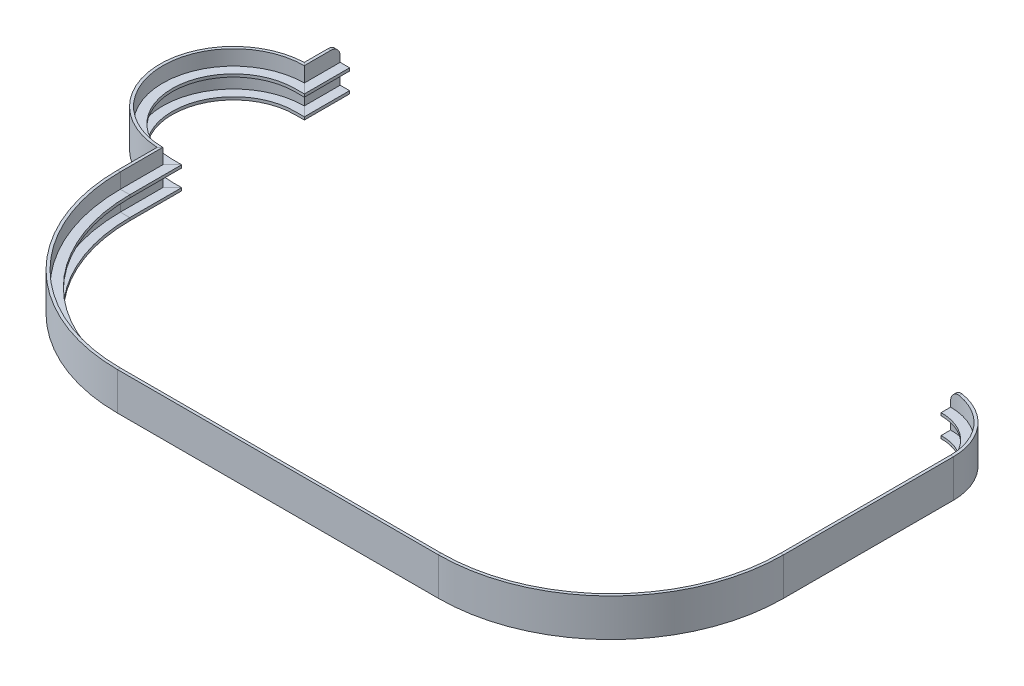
ISO-10303-21;
HEADER;
FILE_DESCRIPTION(('STEP AP214'),'2;1');
FILE_NAME('part.step','',(''),(''),'','','');
FILE_SCHEMA(('AUTOMOTIVE_DESIGN { 1 0 10303 214 1 1 1 1 }'));
ENDSEC;
DATA;
#1=APPLICATION_CONTEXT('core data for automotive mechanical design processes');
#2=APPLICATION_PROTOCOL_DEFINITION('international standard','automotive_design',2000,#1);
#3=PRODUCT_CONTEXT('',#1,'mechanical');
#4=PRODUCT('Part','Part','',(#3));
#5=PRODUCT_RELATED_PRODUCT_CATEGORY('part','',(#4));
#6=PRODUCT_DEFINITION_FORMATION('','',#4);
#7=PRODUCT_DEFINITION_CONTEXT('part definition',#1,'design');
#8=PRODUCT_DEFINITION('design','',#6,#7);
#9=PRODUCT_DEFINITION_SHAPE('','',#8);
#10=(LENGTH_UNIT() NAMED_UNIT(*) SI_UNIT(.MILLI.,.METRE.));
#11=(NAMED_UNIT(*) PLANE_ANGLE_UNIT() SI_UNIT($,.RADIAN.));
#12=(NAMED_UNIT(*) SI_UNIT($,.STERADIAN.) SOLID_ANGLE_UNIT());
#13=UNCERTAINTY_MEASURE_WITH_UNIT(LENGTH_MEASURE(1.E-05),#10,'distance_accuracy_value','');
#14=(GEOMETRIC_REPRESENTATION_CONTEXT(3) GLOBAL_UNCERTAINTY_ASSIGNED_CONTEXT((#13)) GLOBAL_UNIT_ASSIGNED_CONTEXT((#10,
#11,#12)) REPRESENTATION_CONTEXT('',''));
#15=CARTESIAN_POINT('',(0.,0.,0.));
#16=DIRECTION('',(0.,0.,1.));
#17=DIRECTION('',(1.,0.,0.));
#18=AXIS2_PLACEMENT_3D('',#15,#16,#17);
#19=CARTESIAN_POINT('',(-139.,238.5,-58.099999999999));
#20=DIRECTION('',(0.,-1.,0.));
#21=DIRECTION('',(0.,0.,1.));
#22=AXIS2_PLACEMENT_3D('',#19,#20,#21);
#23=PLANE('',#22);
#24=DIRECTION('',(-0.713940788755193,0.,0.700206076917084));
#25=VECTOR('',#24,1.);
#26=CARTESIAN_POINT('',(-137.5,238.5,-52.499999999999));
#27=LINE('',#26,#25);
#28=CARTESIAN_POINT('',(-137.5,238.5,-52.499999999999));
#29=VERTEX_POINT('',#28);
#30=CARTESIAN_POINT('',(-139.,238.5,-51.0288568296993));
#31=VERTEX_POINT('',#30);
#32=EDGE_CURVE('E509',#29,#31,#27,.T.);
#33=ORIENTED_EDGE('',*,*,#32,.T.);
#34=DIRECTION('',(0.,0.,1.));
#35=VECTOR('',#34,1.);
#36=CARTESIAN_POINT('',(-139.,238.5,-58.099999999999));
#37=LINE('',#36,#35);
#38=CARTESIAN_POINT('',(-139.,238.5,-29.999999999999));
#39=VERTEX_POINT('',#38);
#40=EDGE_CURVE('E506',#31,#39,#37,.T.);
#41=ORIENTED_EDGE('',*,*,#40,.T.);
#42=DIRECTION('',(1.,0.,0.));
#43=VECTOR('',#42,1.);
#44=CARTESIAN_POINT('',(-139.,238.5,-29.999999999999));
#45=LINE('',#44,#43);
#46=CARTESIAN_POINT('',(-137.5,238.5,-29.999999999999));
#47=VERTEX_POINT('',#46);
#48=EDGE_CURVE('E508',#39,#47,#45,.T.);
#49=ORIENTED_EDGE('',*,*,#48,.T.);
#50=DIRECTION('',(0.,0.,1.));
#51=VECTOR('',#50,1.);
#52=CARTESIAN_POINT('',(-137.5,238.5,-58.099999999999));
#53=LINE('',#52,#51);
#54=EDGE_CURVE('E496',#29,#47,#53,.T.);
#55=ORIENTED_EDGE('',*,*,#54,.F.);
#56=EDGE_LOOP('',(#33,#41,#49,#55));
#57=FACE_BOUND('',#56,.T.);
#58=ADVANCED_FACE('F36',(#57),#23,.F.);
#59=CARTESIAN_POINT('',(-137.5,238.5,-58.099999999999));
#60=DIRECTION('',(-1.,0.,0.));
#61=DIRECTION('',(0.,0.,1.));
#62=AXIS2_PLACEMENT_3D('',#59,#60,#61);
#63=PLANE('',#62);
#64=ORIENTED_EDGE('',*,*,#54,.T.);
#65=DIRECTION('',(0.,-1.,0.));
#66=VECTOR('',#65,1.);
#67=CARTESIAN_POINT('',(-137.5,238.5,-29.999999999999));
#68=LINE('',#67,#66);
#69=CARTESIAN_POINT('',(-137.5,230.5,-29.999999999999));
#70=VERTEX_POINT('',#69);
#71=EDGE_CURVE('E493',#47,#70,#68,.T.);
#72=ORIENTED_EDGE('',*,*,#71,.T.);
#73=DIRECTION('',(0.,0.,1.));
#74=VECTOR('',#73,1.);
#75=CARTESIAN_POINT('',(-137.5,230.5,-58.099999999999));
#76=LINE('',#75,#74);
#77=CARTESIAN_POINT('',(-137.5,230.5,-52.499999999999));
#78=VERTEX_POINT('',#77);
#79=EDGE_CURVE('E482',#78,#70,#76,.T.);
#80=ORIENTED_EDGE('',*,*,#79,.F.);
#81=DIRECTION('',(0.,-1.,0.));
#82=VECTOR('',#81,1.);
#83=CARTESIAN_POINT('',(-137.5,238.5,-52.499999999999));
#84=LINE('',#83,#82);
#85=EDGE_CURVE('E1865',#29,#78,#84,.T.);
#86=ORIENTED_EDGE('',*,*,#85,.F.);
#87=EDGE_LOOP('',(#64,#72,#80,#86));
#88=FACE_BOUND('',#87,.T.);
#89=ADVANCED_FACE('F1535',(#88),#63,.F.);
#90=CARTESIAN_POINT('',(-137.5,230.5,-58.099999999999));
#91=DIRECTION('',(0.,-1.,0.));
#92=DIRECTION('',(0.,0.,1.));
#93=AXIS2_PLACEMENT_3D('',#90,#91,#92);
#94=PLANE('',#93);
#95=DIRECTION('',(-0.707106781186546,0.,0.707106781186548));
#96=VECTOR('',#95,1.);
#97=CARTESIAN_POINT('',(-132.5,230.5,-57.4999999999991));
#98=LINE('',#97,#96);
#99=CARTESIAN_POINT('',(-132.5,230.5,-57.4999999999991));
#100=VERTEX_POINT('',#99);
#101=EDGE_CURVE('E492',#100,#78,#98,.T.);
#102=ORIENTED_EDGE('',*,*,#101,.T.);
#103=ORIENTED_EDGE('',*,*,#79,.T.);
#104=DIRECTION('',(1.,0.,0.));
#105=VECTOR('',#104,1.);
#106=CARTESIAN_POINT('',(-137.5,230.5,-29.999999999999));
#107=LINE('',#106,#105);
#108=CARTESIAN_POINT('',(-132.5,230.5,-29.999999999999));
#109=VERTEX_POINT('',#108);
#110=EDGE_CURVE('E479',#70,#109,#107,.T.);
#111=ORIENTED_EDGE('',*,*,#110,.T.);
#112=DIRECTION('',(0.,0.,1.));
#113=VECTOR('',#112,1.);
#114=CARTESIAN_POINT('',(-132.5,230.5,-58.099999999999));
#115=LINE('',#114,#113);
#116=EDGE_CURVE('E469',#100,#109,#115,.T.);
#117=ORIENTED_EDGE('',*,*,#116,.F.);
#118=EDGE_LOOP('',(#102,#103,#111,#117));
#119=FACE_BOUND('',#118,.T.);
#120=ADVANCED_FACE('F1525',(#119),#94,.F.);
#121=CARTESIAN_POINT('',(-132.5,230.5,-58.099999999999));
#122=DIRECTION('',(-1.,0.,0.));
#123=DIRECTION('',(0.,0.,1.));
#124=AXIS2_PLACEMENT_3D('',#121,#122,#123);
#125=PLANE('',#124);
#126=ORIENTED_EDGE('',*,*,#116,.T.);
#127=DIRECTION('',(0.,-1.,0.));
#128=VECTOR('',#127,1.);
#129=CARTESIAN_POINT('',(-132.5,230.5,-29.999999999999));
#130=LINE('',#129,#128);
#131=CARTESIAN_POINT('',(-132.5,229.,-29.999999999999));
#132=VERTEX_POINT('',#131);
#133=EDGE_CURVE('E466',#109,#132,#130,.T.);
#134=ORIENTED_EDGE('',*,*,#133,.T.);
#135=DIRECTION('',(0.,0.,1.));
#136=VECTOR('',#135,1.);
#137=CARTESIAN_POINT('',(-132.5,229.,-58.099999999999));
#138=LINE('',#137,#136);
#139=CARTESIAN_POINT('',(-132.5,229.,-57.4999999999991));
#140=VERTEX_POINT('',#139);
#141=EDGE_CURVE('E455',#140,#132,#138,.T.);
#142=ORIENTED_EDGE('',*,*,#141,.F.);
#143=DIRECTION('',(0.,-1.,0.));
#144=VECTOR('',#143,1.);
#145=CARTESIAN_POINT('',(-132.5,229.75,-57.4999999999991));
#146=LINE('',#145,#144);
#147=EDGE_CURVE('E523',#100,#140,#146,.T.);
#148=ORIENTED_EDGE('',*,*,#147,.F.);
#149=EDGE_LOOP('',(#126,#134,#142,#148));
#150=FACE_BOUND('',#149,.T.);
#151=ADVANCED_FACE('F1515',(#150),#125,.F.);
#152=CARTESIAN_POINT('',(-132.5,229.,-58.099999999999));
#153=DIRECTION('',(0.,1.,0.));
#154=DIRECTION('',(0.,0.,-1.));
#155=AXIS2_PLACEMENT_3D('',#152,#153,#154);
#156=PLANE('',#155);
#157=DIRECTION('',(0.707106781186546,0.,-0.707106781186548));
#158=VECTOR('',#157,1.);
#159=CARTESIAN_POINT('',(-137.5,229.,-52.499999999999));
#160=LINE('',#159,#158);
#161=CARTESIAN_POINT('',(-137.5,229.,-52.499999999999));
#162=VERTEX_POINT('',#161);
#163=EDGE_CURVE('E465',#162,#140,#160,.T.);
#164=ORIENTED_EDGE('',*,*,#163,.T.);
#165=ORIENTED_EDGE('',*,*,#141,.T.);
#166=DIRECTION('',(-1.,0.,0.));
#167=VECTOR('',#166,1.);
#168=CARTESIAN_POINT('',(-132.5,229.,-29.999999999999));
#169=LINE('',#168,#167);
#170=CARTESIAN_POINT('',(-137.5,229.,-29.999999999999));
#171=VERTEX_POINT('',#170);
#172=EDGE_CURVE('E452',#132,#171,#169,.T.);
#173=ORIENTED_EDGE('',*,*,#172,.T.);
#174=DIRECTION('',(0.,0.,1.));
#175=VECTOR('',#174,1.);
#176=CARTESIAN_POINT('',(-137.5,229.,-58.099999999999));
#177=LINE('',#176,#175);
#178=EDGE_CURVE('E442',#162,#171,#177,.T.);
#179=ORIENTED_EDGE('',*,*,#178,.F.);
#180=EDGE_LOOP('',(#164,#165,#173,#179));
#181=FACE_BOUND('',#180,.T.);
#182=ADVANCED_FACE('F1505',(#181),#156,.F.);
#183=CARTESIAN_POINT('',(-137.5,229.,-58.099999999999));
#184=DIRECTION('',(-1.,0.,0.));
#185=DIRECTION('',(0.,0.,1.));
#186=AXIS2_PLACEMENT_3D('',#183,#184,#185);
#187=PLANE('',#186);
#188=ORIENTED_EDGE('',*,*,#178,.T.);
#189=DIRECTION('',(0.,-1.,0.));
#190=VECTOR('',#189,1.);
#191=CARTESIAN_POINT('',(-137.5,229.,-29.999999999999));
#192=LINE('',#191,#190);
#193=CARTESIAN_POINT('',(-137.5,220.,-29.999999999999));
#194=VERTEX_POINT('',#193);
#195=EDGE_CURVE('E439',#171,#194,#192,.T.);
#196=ORIENTED_EDGE('',*,*,#195,.T.);
#197=DIRECTION('',(0.,0.,1.));
#198=VECTOR('',#197,1.);
#199=CARTESIAN_POINT('',(-137.5,220.,-58.099999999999));
#200=LINE('',#199,#198);
#201=CARTESIAN_POINT('',(-137.5,220.,-52.499999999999));
#202=VERTEX_POINT('',#201);
#203=EDGE_CURVE('E428',#202,#194,#200,.T.);
#204=ORIENTED_EDGE('',*,*,#203,.F.);
#205=DIRECTION('',(0.,-1.,0.));
#206=VECTOR('',#205,1.);
#207=CARTESIAN_POINT('',(-137.5,229.,-52.499999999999));
#208=LINE('',#207,#206);
#209=EDGE_CURVE('E526',#162,#202,#208,.T.);
#210=ORIENTED_EDGE('',*,*,#209,.F.);
#211=EDGE_LOOP('',(#188,#196,#204,#210));
#212=FACE_BOUND('',#211,.T.);
#213=ADVANCED_FACE('F1495',(#212),#187,.F.);
#214=CARTESIAN_POINT('',(-137.5,220.,-58.099999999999));
#215=DIRECTION('',(0.,-1.,0.));
#216=DIRECTION('',(0.,0.,1.));
#217=AXIS2_PLACEMENT_3D('',#214,#215,#216);
#218=PLANE('',#217);
#219=DIRECTION('',(-0.707106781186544,0.,0.70710678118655));
#220=VECTOR('',#219,1.);
#221=CARTESIAN_POINT('',(-132.5,220.,-57.4999999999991));
#222=LINE('',#221,#220);
#223=CARTESIAN_POINT('',(-132.5,220.,-57.4999999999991));
#224=VERTEX_POINT('',#223);
#225=EDGE_CURVE('E438',#224,#202,#222,.T.);
#226=ORIENTED_EDGE('',*,*,#225,.T.);
#227=ORIENTED_EDGE('',*,*,#203,.T.);
#228=DIRECTION('',(1.,0.,0.));
#229=VECTOR('',#228,1.);
#230=CARTESIAN_POINT('',(-137.5,220.,-29.999999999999));
#231=LINE('',#230,#229);
#232=CARTESIAN_POINT('',(-132.5,220.,-29.999999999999));
#233=VERTEX_POINT('',#232);
#234=EDGE_CURVE('E425',#194,#233,#231,.T.);
#235=ORIENTED_EDGE('',*,*,#234,.T.);
#236=DIRECTION('',(0.,0.,1.));
#237=VECTOR('',#236,1.);
#238=CARTESIAN_POINT('',(-132.5,220.,-58.099999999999));
#239=LINE('',#238,#237);
#240=EDGE_CURVE('E415',#224,#233,#239,.T.);
#241=ORIENTED_EDGE('',*,*,#240,.F.);
#242=EDGE_LOOP('',(#226,#227,#235,#241));
#243=FACE_BOUND('',#242,.T.);
#244=ADVANCED_FACE('F1485',(#243),#218,.F.);
#245=CARTESIAN_POINT('',(-132.5,220.,-58.099999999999));
#246=DIRECTION('',(-1.,0.,0.));
#247=DIRECTION('',(0.,0.,1.));
#248=AXIS2_PLACEMENT_3D('',#245,#246,#247);
#249=PLANE('',#248);
#250=ORIENTED_EDGE('',*,*,#240,.T.);
#251=DIRECTION('',(0.,-1.,0.));
#252=VECTOR('',#251,1.);
#253=CARTESIAN_POINT('',(-132.5,220.,-29.999999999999));
#254=LINE('',#253,#252);
#255=CARTESIAN_POINT('',(-132.5,218.5,-29.999999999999));
#256=VERTEX_POINT('',#255);
#257=EDGE_CURVE('E412',#233,#256,#254,.T.);
#258=ORIENTED_EDGE('',*,*,#257,.T.);
#259=DIRECTION('',(0.,0.,1.));
#260=VECTOR('',#259,1.);
#261=CARTESIAN_POINT('',(-132.5,218.5,-58.099999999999));
#262=LINE('',#261,#260);
#263=CARTESIAN_POINT('',(-132.5,218.5,-57.4999999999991));
#264=VERTEX_POINT('',#263);
#265=EDGE_CURVE('E405',#264,#256,#262,.T.);
#266=ORIENTED_EDGE('',*,*,#265,.F.);
#267=DIRECTION('',(0.,-1.,0.));
#268=VECTOR('',#267,1.);
#269=CARTESIAN_POINT('',(-132.5,219.25,-57.4999999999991));
#270=LINE('',#269,#268);
#271=EDGE_CURVE('E527',#224,#264,#270,.T.);
#272=ORIENTED_EDGE('',*,*,#271,.F.);
#273=EDGE_LOOP('',(#250,#258,#266,#272));
#274=FACE_BOUND('',#273,.T.);
#275=ADVANCED_FACE('F1475',(#274),#249,.F.);
#276=CARTESIAN_POINT('',(-132.5,218.5,-58.099999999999));
#277=DIRECTION('',(0.,1.,0.));
#278=DIRECTION('',(0.,0.,-1.));
#279=AXIS2_PLACEMENT_3D('',#276,#277,#278);
#280=PLANE('',#279);
#281=DIRECTION('',(0.708678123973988,0.,-0.7055319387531));
#282=VECTOR('',#281,1.);
#283=CARTESIAN_POINT('',(-139.,218.5,-51.0288568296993));
#284=LINE('',#283,#282);
#285=CARTESIAN_POINT('',(-139.,218.5,-51.0288568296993));
#286=VERTEX_POINT('',#285);
#287=EDGE_CURVE('E411',#286,#264,#284,.T.);
#288=ORIENTED_EDGE('',*,*,#287,.T.);
#289=ORIENTED_EDGE('',*,*,#265,.T.);
#290=DIRECTION('',(-1.,0.,0.));
#291=VECTOR('',#290,1.);
#292=CARTESIAN_POINT('',(-132.5,218.5,-29.999999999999));
#293=LINE('',#292,#291);
#294=CARTESIAN_POINT('',(-139.,218.5,-29.999999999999));
#295=VERTEX_POINT('',#294);
#296=EDGE_CURVE('E402',#256,#295,#293,.T.);
#297=ORIENTED_EDGE('',*,*,#296,.T.);
#298=DIRECTION('',(0.,0.,1.));
#299=VECTOR('',#298,1.);
#300=CARTESIAN_POINT('',(-139.,218.5,-58.099999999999));
#301=LINE('',#300,#299);
#302=EDGE_CURVE('E400',#286,#295,#301,.T.);
#303=ORIENTED_EDGE('',*,*,#302,.F.);
#304=EDGE_LOOP('',(#288,#289,#297,#303));
#305=FACE_BOUND('',#304,.T.);
#306=ADVANCED_FACE('F1465',(#305),#280,.F.);
#307=CARTESIAN_POINT('',(-139.,238.5,-29.999999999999));
#308=DIRECTION('',(0.,-1.,0.));
#309=DIRECTION('',(0.,0.,1.));
#310=AXIS2_PLACEMENT_3D('',#307,#308,#309);
#311=PLANE('',#310);
#312=CARTESIAN_POINT('',(-47.4999999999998,238.5,-29.9999999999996));
#313=DIRECTION('',(0.,1.,0.));
#314=DIRECTION('',(-1.,0.,0.));
#315=AXIS2_PLACEMENT_3D('',#312,#313,#314);
#316=CIRCLE('',#315,90.0000000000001);
#317=CARTESIAN_POINT('',(-47.4999999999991,238.5,60.0000000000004));
#318=VERTEX_POINT('',#317);
#319=EDGE_CURVE('E490',#47,#318,#316,.T.);
#320=ORIENTED_EDGE('',*,*,#319,.F.);
#321=ORIENTED_EDGE('',*,*,#48,.F.);
#322=CARTESIAN_POINT('',(-47.4999999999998,238.5,-29.9999999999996));
#323=DIRECTION('',(0.,1.,0.));
#324=DIRECTION('',(-1.,0.,0.));
#325=AXIS2_PLACEMENT_3D('',#322,#323,#324);
#326=CIRCLE('',#325,91.5000000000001);
#327=CARTESIAN_POINT('',(-47.4999999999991,238.5,61.5000000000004));
#328=VERTEX_POINT('',#327);
#329=EDGE_CURVE('E404',#39,#328,#326,.T.);
#330=ORIENTED_EDGE('',*,*,#329,.T.);
#331=DIRECTION('',(0.,0.,-1.));
#332=VECTOR('',#331,1.);
#333=CARTESIAN_POINT('',(-47.4999999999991,238.5,61.5000000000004));
#334=LINE('',#333,#332);
#335=EDGE_CURVE('E501',#328,#318,#334,.T.);
#336=ORIENTED_EDGE('',*,*,#335,.T.);
#337=EDGE_LOOP('',(#320,#321,#330,#336));
#338=FACE_BOUND('',#337,.T.);
#339=ADVANCED_FACE('F1455',(#338),#311,.F.);
#340=CARTESIAN_POINT('',(-47.4999999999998,229.,-29.9999999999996));
#341=DIRECTION('',(0.,1.,0.));
#342=DIRECTION('',(0.,0.,-1.));
#343=AXIS2_PLACEMENT_3D('',#340,#341,#342);
#344=CYLINDRICAL_SURFACE('',#343,90.0000000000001);
#345=CARTESIAN_POINT('',(-47.4999999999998,230.5,-29.9999999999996));
#346=DIRECTION('',(0.,1.,0.));
#347=DIRECTION('',(-1.,0.,0.));
#348=AXIS2_PLACEMENT_3D('',#345,#346,#347);
#349=CIRCLE('',#348,90.0000000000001);
#350=CARTESIAN_POINT('',(-47.4999999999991,230.5,60.0000000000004));
#351=VERTEX_POINT('',#350);
#352=EDGE_CURVE('E477',#70,#351,#349,.T.);
#353=ORIENTED_EDGE('',*,*,#352,.F.);
#354=ORIENTED_EDGE('',*,*,#71,.F.);
#355=ORIENTED_EDGE('',*,*,#319,.T.);
#356=DIRECTION('',(0.,-1.,0.));
#357=VECTOR('',#356,1.);
#358=CARTESIAN_POINT('',(-47.4999999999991,238.5,60.0000000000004));
#359=LINE('',#358,#357);
#360=EDGE_CURVE('E487',#318,#351,#359,.T.);
#361=ORIENTED_EDGE('',*,*,#360,.T.);
#362=EDGE_LOOP('',(#353,#354,#355,#361));
#363=FACE_BOUND('',#362,.T.);
#364=ADVANCED_FACE('F1445',(#363),#344,.F.);
#365=CARTESIAN_POINT('',(-137.5,230.5,-29.999999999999));
#366=DIRECTION('',(0.,-1.,0.));
#367=DIRECTION('',(0.,0.,1.));
#368=AXIS2_PLACEMENT_3D('',#365,#366,#367);
#369=PLANE('',#368);
#370=CARTESIAN_POINT('',(-47.4999999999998,230.5,-29.9999999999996));
#371=DIRECTION('',(0.,1.,0.));
#372=DIRECTION('',(-1.,0.,0.));
#373=AXIS2_PLACEMENT_3D('',#370,#371,#372);
#374=CIRCLE('',#373,85.);
#375=CARTESIAN_POINT('',(-47.4999999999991,230.5,55.0000000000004));
#376=VERTEX_POINT('',#375);
#377=EDGE_CURVE('E463',#109,#376,#374,.T.);
#378=ORIENTED_EDGE('',*,*,#377,.F.);
#379=ORIENTED_EDGE('',*,*,#110,.F.);
#380=ORIENTED_EDGE('',*,*,#352,.T.);
#381=DIRECTION('',(0.,0.,-1.));
#382=VECTOR('',#381,1.);
#383=CARTESIAN_POINT('',(-47.4999999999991,230.5,60.0000000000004));
#384=LINE('',#383,#382);
#385=EDGE_CURVE('E474',#351,#376,#384,.T.);
#386=ORIENTED_EDGE('',*,*,#385,.T.);
#387=EDGE_LOOP('',(#378,#379,#380,#386));
#388=FACE_BOUND('',#387,.T.);
#389=ADVANCED_FACE('F1435',(#388),#369,.F.);
#390=CARTESIAN_POINT('',(-47.4999999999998,229.,-29.9999999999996));
#391=DIRECTION('',(0.,1.,0.));
#392=DIRECTION('',(0.,0.,-1.));
#393=AXIS2_PLACEMENT_3D('',#390,#391,#392);
#394=CYLINDRICAL_SURFACE('',#393,85.);
#395=CARTESIAN_POINT('',(-47.4999999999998,229.,-29.9999999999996));
#396=DIRECTION('',(0.,1.,0.));
#397=DIRECTION('',(-1.,0.,0.));
#398=AXIS2_PLACEMENT_3D('',#395,#396,#397);
#399=CIRCLE('',#398,85.);
#400=CARTESIAN_POINT('',(-47.4999999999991,229.,55.0000000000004));
#401=VERTEX_POINT('',#400);
#402=EDGE_CURVE('E450',#132,#401,#399,.T.);
#403=ORIENTED_EDGE('',*,*,#402,.F.);
#404=ORIENTED_EDGE('',*,*,#133,.F.);
#405=ORIENTED_EDGE('',*,*,#377,.T.);
#406=DIRECTION('',(0.,-1.,0.));
#407=VECTOR('',#406,1.);
#408=CARTESIAN_POINT('',(-47.4999999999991,230.5,55.0000000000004));
#409=LINE('',#408,#407);
#410=EDGE_CURVE('E460',#376,#401,#409,.T.);
#411=ORIENTED_EDGE('',*,*,#410,.T.);
#412=EDGE_LOOP('',(#403,#404,#405,#411));
#413=FACE_BOUND('',#412,.T.);
#414=ADVANCED_FACE('F1425',(#413),#394,.F.);
#415=CARTESIAN_POINT('',(-132.5,229.,-29.999999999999));
#416=DIRECTION('',(0.,1.,0.));
#417=DIRECTION('',(0.,0.,-1.));
#418=AXIS2_PLACEMENT_3D('',#415,#416,#417);
#419=PLANE('',#418);
#420=CARTESIAN_POINT('',(-47.4999999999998,229.,-29.9999999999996));
#421=DIRECTION('',(0.,1.,0.));
#422=DIRECTION('',(-1.,0.,0.));
#423=AXIS2_PLACEMENT_3D('',#420,#421,#422);
#424=CIRCLE('',#423,90.0000000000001);
#425=CARTESIAN_POINT('',(-47.4999999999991,229.,60.0000000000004));
#426=VERTEX_POINT('',#425);
#427=EDGE_CURVE('E436',#171,#426,#424,.T.);
#428=ORIENTED_EDGE('',*,*,#427,.F.);
#429=ORIENTED_EDGE('',*,*,#172,.F.);
#430=ORIENTED_EDGE('',*,*,#402,.T.);
#431=DIRECTION('',(0.,0.,1.));
#432=VECTOR('',#431,1.);
#433=CARTESIAN_POINT('',(-47.4999999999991,229.,55.0000000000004));
#434=LINE('',#433,#432);
#435=EDGE_CURVE('E447',#401,#426,#434,.T.);
#436=ORIENTED_EDGE('',*,*,#435,.T.);
#437=EDGE_LOOP('',(#428,#429,#430,#436));
#438=FACE_BOUND('',#437,.T.);
#439=ADVANCED_FACE('F1415',(#438),#419,.F.);
#440=CARTESIAN_POINT('',(-47.4999999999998,229.,-29.9999999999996));
#441=DIRECTION('',(0.,1.,0.));
#442=DIRECTION('',(0.,0.,-1.));
#443=AXIS2_PLACEMENT_3D('',#440,#441,#442);
#444=CYLINDRICAL_SURFACE('',#443,90.0000000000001);
#445=CARTESIAN_POINT('',(-47.4999999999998,220.,-29.9999999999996));
#446=DIRECTION('',(0.,1.,0.));
#447=DIRECTION('',(-1.,0.,0.));
#448=AXIS2_PLACEMENT_3D('',#445,#446,#447);
#449=CIRCLE('',#448,90.0000000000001);
#450=CARTESIAN_POINT('',(-47.4999999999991,220.,60.0000000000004));
#451=VERTEX_POINT('',#450);
#452=EDGE_CURVE('E423',#194,#451,#449,.T.);
#453=ORIENTED_EDGE('',*,*,#452,.F.);
#454=ORIENTED_EDGE('',*,*,#195,.F.);
#455=ORIENTED_EDGE('',*,*,#427,.T.);
#456=DIRECTION('',(0.,-1.,0.));
#457=VECTOR('',#456,1.);
#458=CARTESIAN_POINT('',(-47.4999999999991,229.,60.0000000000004));
#459=LINE('',#458,#457);
#460=EDGE_CURVE('E433',#426,#451,#459,.T.);
#461=ORIENTED_EDGE('',*,*,#460,.T.);
#462=EDGE_LOOP('',(#453,#454,#455,#461));
#463=FACE_BOUND('',#462,.T.);
#464=ADVANCED_FACE('F1405',(#463),#444,.F.);
#465=CARTESIAN_POINT('',(-137.5,220.,-29.999999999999));
#466=DIRECTION('',(0.,-1.,0.));
#467=DIRECTION('',(0.,0.,1.));
#468=AXIS2_PLACEMENT_3D('',#465,#466,#467);
#469=PLANE('',#468);
#470=CARTESIAN_POINT('',(-47.4999999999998,220.,-29.9999999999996));
#471=DIRECTION('',(0.,1.,0.));
#472=DIRECTION('',(-1.,0.,0.));
#473=AXIS2_PLACEMENT_3D('',#470,#471,#472);
#474=CIRCLE('',#473,85.);
#475=CARTESIAN_POINT('',(-47.4999999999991,220.,55.0000000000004));
#476=VERTEX_POINT('',#475);
#477=EDGE_CURVE('E409',#233,#476,#474,.T.);
#478=ORIENTED_EDGE('',*,*,#477,.F.);
#479=ORIENTED_EDGE('',*,*,#234,.F.);
#480=ORIENTED_EDGE('',*,*,#452,.T.);
#481=DIRECTION('',(0.,0.,-1.));
#482=VECTOR('',#481,1.);
#483=CARTESIAN_POINT('',(-47.4999999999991,220.,60.0000000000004));
#484=LINE('',#483,#482);
#485=EDGE_CURVE('E420',#451,#476,#484,.T.);
#486=ORIENTED_EDGE('',*,*,#485,.T.);
#487=EDGE_LOOP('',(#478,#479,#480,#486));
#488=FACE_BOUND('',#487,.T.);
#489=ADVANCED_FACE('F1395',(#488),#469,.F.);
#490=CARTESIAN_POINT('',(-47.4999999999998,229.,-29.9999999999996));
#491=DIRECTION('',(0.,1.,0.));
#492=DIRECTION('',(0.,0.,-1.));
#493=AXIS2_PLACEMENT_3D('',#490,#491,#492);
#494=CYLINDRICAL_SURFACE('',#493,85.);
#495=CARTESIAN_POINT('',(-47.4999999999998,218.5,-29.9999999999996));
#496=DIRECTION('',(0.,1.,0.));
#497=DIRECTION('',(-1.,0.,0.));
#498=AXIS2_PLACEMENT_3D('',#495,#496,#497);
#499=CIRCLE('',#498,85.);
#500=CARTESIAN_POINT('',(-47.4999999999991,218.5,55.0000000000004));
#501=VERTEX_POINT('',#500);
#502=EDGE_CURVE('E394',#256,#501,#499,.T.);
#503=ORIENTED_EDGE('',*,*,#502,.F.);
#504=ORIENTED_EDGE('',*,*,#257,.F.);
#505=ORIENTED_EDGE('',*,*,#477,.T.);
#506=DIRECTION('',(0.,-1.,0.));
#507=VECTOR('',#506,1.);
#508=CARTESIAN_POINT('',(-47.4999999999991,220.,55.0000000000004));
#509=LINE('',#508,#507);
#510=EDGE_CURVE('E397',#476,#501,#509,.T.);
#511=ORIENTED_EDGE('',*,*,#510,.T.);
#512=EDGE_LOOP('',(#503,#504,#505,#511));
#513=FACE_BOUND('',#512,.T.);
#514=ADVANCED_FACE('F1386',(#513),#494,.F.);
#515=CARTESIAN_POINT('',(-132.5,218.5,-29.999999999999));
#516=DIRECTION('',(0.,1.,0.));
#517=DIRECTION('',(0.,0.,-1.));
#518=AXIS2_PLACEMENT_3D('',#515,#516,#517);
#519=PLANE('',#518);
#520=CARTESIAN_POINT('',(-47.4999999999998,218.5,-29.9999999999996));
#521=DIRECTION('',(0.,1.,0.));
#522=DIRECTION('',(-1.,0.,0.));
#523=AXIS2_PLACEMENT_3D('',#520,#521,#522);
#524=CIRCLE('',#523,91.5000000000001);
#525=CARTESIAN_POINT('',(-47.4999999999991,218.5,61.5000000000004));
#526=VERTEX_POINT('',#525);
#527=EDGE_CURVE('E381',#295,#526,#524,.T.);
#528=ORIENTED_EDGE('',*,*,#527,.F.);
#529=ORIENTED_EDGE('',*,*,#296,.F.);
#530=ORIENTED_EDGE('',*,*,#502,.T.);
#531=DIRECTION('',(0.,0.,1.));
#532=VECTOR('',#531,1.);
#533=CARTESIAN_POINT('',(-47.4999999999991,218.5,55.0000000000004));
#534=LINE('',#533,#532);
#535=EDGE_CURVE('E362',#501,#526,#534,.T.);
#536=ORIENTED_EDGE('',*,*,#535,.T.);
#537=EDGE_LOOP('',(#528,#529,#530,#536));
#538=FACE_BOUND('',#537,.T.);
#539=ADVANCED_FACE('F392',(#538),#519,.F.);
#540=CARTESIAN_POINT('',(-47.4999999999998,229.,-29.9999999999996));
#541=DIRECTION('',(0.,1.,0.));
#542=DIRECTION('',(0.,0.,-1.));
#543=AXIS2_PLACEMENT_3D('',#540,#541,#542);
#544=CYLINDRICAL_SURFACE('',#543,91.5000000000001);
#545=DIRECTION('',(0.,1.,0.));
#546=VECTOR('',#545,1.);
#547=CARTESIAN_POINT('',(-47.4999999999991,218.5,61.5000000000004));
#548=LINE('',#547,#546);
#549=EDGE_CURVE('E374',#526,#328,#548,.T.);
#550=ORIENTED_EDGE('',*,*,#549,.T.);
#551=ORIENTED_EDGE('',*,*,#329,.F.);
#552=DIRECTION('',(0.,1.,0.));
#553=VECTOR('',#552,1.);
#554=CARTESIAN_POINT('',(-139.,218.5,-29.999999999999));
#555=LINE('',#554,#553);
#556=EDGE_CURVE('E387',#295,#39,#555,.T.);
#557=ORIENTED_EDGE('',*,*,#556,.F.);
#558=ORIENTED_EDGE('',*,*,#527,.T.);
#559=EDGE_LOOP('',(#550,#551,#557,#558));
#560=FACE_BOUND('',#559,.T.);
#561=ADVANCED_FACE('F385',(#560),#544,.T.);
#562=CARTESIAN_POINT('',(-47.4999999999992,238.5,61.5000000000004));
#563=DIRECTION('',(0.,-1.,0.));
#564=DIRECTION('',(0.,0.,1.));
#565=AXIS2_PLACEMENT_3D('',#562,#563,#564);
#566=PLANE('',#565);
#567=DIRECTION('',(1.,0.,0.));
#568=VECTOR('',#567,1.);
#569=CARTESIAN_POINT('',(-47.4999999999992,238.5,60.0000000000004));
#570=LINE('',#569,#568);
#571=CARTESIAN_POINT('',(122.500000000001,238.5,59.9999999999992));
#572=VERTEX_POINT('',#571);
#573=EDGE_CURVE('E484',#318,#572,#570,.T.);
#574=ORIENTED_EDGE('',*,*,#573,.F.);
#575=ORIENTED_EDGE('',*,*,#335,.F.);
#576=DIRECTION('',(1.,0.,0.));
#577=VECTOR('',#576,1.);
#578=CARTESIAN_POINT('',(-47.4999999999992,238.5,61.5000000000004));
#579=LINE('',#578,#577);
#580=CARTESIAN_POINT('',(122.500000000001,238.5,61.4999999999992));
#581=VERTEX_POINT('',#580);
#582=EDGE_CURVE('E377',#328,#581,#579,.T.);
#583=ORIENTED_EDGE('',*,*,#582,.T.);
#584=DIRECTION('',(0.,0.,1.));
#585=VECTOR('',#584,1.);
#586=CARTESIAN_POINT('',(122.500000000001,238.5,59.9999999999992));
#587=LINE('',#586,#585);
#588=EDGE_CURVE('E1028',#572,#581,#587,.T.);
#589=ORIENTED_EDGE('',*,*,#588,.F.);
#590=EDGE_LOOP('',(#574,#575,#583,#589));
#591=FACE_BOUND('',#590,.T.);
#592=ADVANCED_FACE('F1062',(#591),#566,.F.);
#593=CARTESIAN_POINT('',(-47.4999999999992,238.5,60.0000000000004));
#594=DIRECTION('',(0.,0.,1.));
#595=DIRECTION('',(1.,0.,0.));
#596=AXIS2_PLACEMENT_3D('',#593,#594,#595);
#597=PLANE('',#596);
#598=DIRECTION('',(1.,0.,0.));
#599=VECTOR('',#598,1.);
#600=CARTESIAN_POINT('',(-47.4999999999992,230.5,60.0000000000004));
#601=LINE('',#600,#599);
#602=CARTESIAN_POINT('',(122.500000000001,230.5,59.9999999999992));
#603=VERTEX_POINT('',#602);
#604=EDGE_CURVE('E471',#351,#603,#601,.T.);
#605=ORIENTED_EDGE('',*,*,#604,.F.);
#606=ORIENTED_EDGE('',*,*,#360,.F.);
#607=ORIENTED_EDGE('',*,*,#573,.T.);
#608=DIRECTION('',(0.,1.,0.));
#609=VECTOR('',#608,1.);
#610=CARTESIAN_POINT('',(122.500000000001,230.5,59.9999999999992));
#611=LINE('',#610,#609);
#612=EDGE_CURVE('E892',#603,#572,#611,.T.);
#613=ORIENTED_EDGE('',*,*,#612,.F.);
#614=EDGE_LOOP('',(#605,#606,#607,#613));
#615=FACE_BOUND('',#614,.T.);
#616=ADVANCED_FACE('F1346',(#615),#597,.F.);
#617=CARTESIAN_POINT('',(-47.4999999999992,230.5,60.0000000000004));
#618=DIRECTION('',(0.,-1.,0.));
#619=DIRECTION('',(0.,0.,1.));
#620=AXIS2_PLACEMENT_3D('',#617,#618,#619);
#621=PLANE('',#620);
#622=DIRECTION('',(1.,0.,0.));
#623=VECTOR('',#622,1.);
#624=CARTESIAN_POINT('',(-47.4999999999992,230.5,55.0000000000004));
#625=LINE('',#624,#623);
#626=CARTESIAN_POINT('',(122.500000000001,230.5,54.9999999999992));
#627=VERTEX_POINT('',#626);
#628=EDGE_CURVE('E457',#376,#627,#625,.T.);
#629=ORIENTED_EDGE('',*,*,#628,.F.);
#630=ORIENTED_EDGE('',*,*,#385,.F.);
#631=ORIENTED_EDGE('',*,*,#604,.T.);
#632=DIRECTION('',(0.,0.,1.));
#633=VECTOR('',#632,1.);
#634=CARTESIAN_POINT('',(122.500000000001,230.5,54.9999999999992));
#635=LINE('',#634,#633);
#636=EDGE_CURVE('E821',#627,#603,#635,.T.);
#637=ORIENTED_EDGE('',*,*,#636,.F.);
#638=EDGE_LOOP('',(#629,#630,#631,#637));
#639=FACE_BOUND('',#638,.T.);
#640=ADVANCED_FACE('F1334',(#639),#621,.F.);
#641=CARTESIAN_POINT('',(-47.4999999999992,230.5,55.0000000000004));
#642=DIRECTION('',(0.,0.,1.));
#643=DIRECTION('',(1.,0.,0.));
#644=AXIS2_PLACEMENT_3D('',#641,#642,#643);
#645=PLANE('',#644);
#646=DIRECTION('',(1.,0.,0.));
#647=VECTOR('',#646,1.);
#648=CARTESIAN_POINT('',(-47.4999999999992,229.,55.0000000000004));
#649=LINE('',#648,#647);
#650=CARTESIAN_POINT('',(122.500000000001,229.,54.9999999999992));
#651=VERTEX_POINT('',#650);
#652=EDGE_CURVE('E444',#401,#651,#649,.T.);
#653=ORIENTED_EDGE('',*,*,#652,.F.);
#654=ORIENTED_EDGE('',*,*,#410,.F.);
#655=ORIENTED_EDGE('',*,*,#628,.T.);
#656=DIRECTION('',(0.,1.,0.));
#657=VECTOR('',#656,1.);
#658=CARTESIAN_POINT('',(122.500000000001,229.,54.9999999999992));
#659=LINE('',#658,#657);
#660=EDGE_CURVE('E905',#651,#627,#659,.T.);
#661=ORIENTED_EDGE('',*,*,#660,.F.);
#662=EDGE_LOOP('',(#653,#654,#655,#661));
#663=FACE_BOUND('',#662,.T.);
#664=ADVANCED_FACE('F1322',(#663),#645,.F.);
#665=CARTESIAN_POINT('',(-47.4999999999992,229.,55.0000000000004));
#666=DIRECTION('',(0.,1.,0.));
#667=DIRECTION('',(0.,0.,-1.));
#668=AXIS2_PLACEMENT_3D('',#665,#666,#667);
#669=PLANE('',#668);
#670=DIRECTION('',(1.,0.,0.));
#671=VECTOR('',#670,1.);
#672=CARTESIAN_POINT('',(-47.4999999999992,229.,60.0000000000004));
#673=LINE('',#672,#671);
#674=CARTESIAN_POINT('',(122.500000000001,229.,59.9999999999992));
#675=VERTEX_POINT('',#674);
#676=EDGE_CURVE('E430',#426,#675,#673,.T.);
#677=ORIENTED_EDGE('',*,*,#676,.F.);
#678=ORIENTED_EDGE('',*,*,#435,.F.);
#679=ORIENTED_EDGE('',*,*,#652,.T.);
#680=DIRECTION('',(0.,0.,-1.));
#681=VECTOR('',#680,1.);
#682=CARTESIAN_POINT('',(122.500000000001,229.,59.9999999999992));
#683=LINE('',#682,#681);
#684=EDGE_CURVE('E908',#675,#651,#683,.T.);
#685=ORIENTED_EDGE('',*,*,#684,.F.);
#686=EDGE_LOOP('',(#677,#678,#679,#685));
#687=FACE_BOUND('',#686,.T.);
#688=ADVANCED_FACE('F1310',(#687),#669,.F.);
#689=CARTESIAN_POINT('',(-47.4999999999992,229.,60.0000000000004));
#690=DIRECTION('',(0.,0.,1.));
#691=DIRECTION('',(1.,0.,0.));
#692=AXIS2_PLACEMENT_3D('',#689,#690,#691);
#693=PLANE('',#692);
#694=DIRECTION('',(1.,0.,0.));
#695=VECTOR('',#694,1.);
#696=CARTESIAN_POINT('',(-47.4999999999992,220.,60.0000000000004));
#697=LINE('',#696,#695);
#698=CARTESIAN_POINT('',(122.500000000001,220.,59.9999999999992));
#699=VERTEX_POINT('',#698);
#700=EDGE_CURVE('E417',#451,#699,#697,.T.);
#701=ORIENTED_EDGE('',*,*,#700,.F.);
#702=ORIENTED_EDGE('',*,*,#460,.F.);
#703=ORIENTED_EDGE('',*,*,#676,.T.);
#704=DIRECTION('',(0.,1.,0.));
#705=VECTOR('',#704,1.);
#706=CARTESIAN_POINT('',(122.500000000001,220.,59.9999999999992));
#707=LINE('',#706,#705);
#708=EDGE_CURVE('E933',#699,#675,#707,.T.);
#709=ORIENTED_EDGE('',*,*,#708,.F.);
#710=EDGE_LOOP('',(#701,#702,#703,#709));
#711=FACE_BOUND('',#710,.T.);
#712=ADVANCED_FACE('F1298',(#711),#693,.F.);
#713=CARTESIAN_POINT('',(-47.4999999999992,220.,60.0000000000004));
#714=DIRECTION('',(0.,-1.,0.));
#715=DIRECTION('',(0.,0.,1.));
#716=AXIS2_PLACEMENT_3D('',#713,#714,#715);
#717=PLANE('',#716);
#718=DIRECTION('',(1.,0.,0.));
#719=VECTOR('',#718,1.);
#720=CARTESIAN_POINT('',(-47.4999999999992,220.,55.0000000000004));
#721=LINE('',#720,#719);
#722=CARTESIAN_POINT('',(122.500000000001,220.,54.9999999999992));
#723=VERTEX_POINT('',#722);
#724=EDGE_CURVE('E406',#476,#723,#721,.T.);
#725=ORIENTED_EDGE('',*,*,#724,.F.);
#726=ORIENTED_EDGE('',*,*,#485,.F.);
#727=ORIENTED_EDGE('',*,*,#700,.T.);
#728=DIRECTION('',(0.,0.,1.));
#729=VECTOR('',#728,1.);
#730=CARTESIAN_POINT('',(122.500000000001,220.,54.9999999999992));
#731=LINE('',#730,#729);
#732=EDGE_CURVE('E951',#723,#699,#731,.T.);
#733=ORIENTED_EDGE('',*,*,#732,.F.);
#734=EDGE_LOOP('',(#725,#726,#727,#733));
#735=FACE_BOUND('',#734,.T.);
#736=ADVANCED_FACE('F1286',(#735),#717,.F.);
#737=CARTESIAN_POINT('',(-47.4999999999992,220.,55.0000000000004));
#738=DIRECTION('',(0.,0.,1.));
#739=DIRECTION('',(1.,0.,0.));
#740=AXIS2_PLACEMENT_3D('',#737,#738,#739);
#741=PLANE('',#740);
#742=DIRECTION('',(1.,0.,0.));
#743=VECTOR('',#742,1.);
#744=CARTESIAN_POINT('',(-47.4999999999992,218.5,55.0000000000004));
#745=LINE('',#744,#743);
#746=CARTESIAN_POINT('',(122.500000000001,218.5,54.9999999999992));
#747=VERTEX_POINT('',#746);
#748=EDGE_CURVE('E371',#501,#747,#745,.T.);
#749=ORIENTED_EDGE('',*,*,#748,.F.);
#750=ORIENTED_EDGE('',*,*,#510,.F.);
#751=ORIENTED_EDGE('',*,*,#724,.T.);
#752=DIRECTION('',(0.,1.,0.));
#753=VECTOR('',#752,1.);
#754=CARTESIAN_POINT('',(122.500000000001,218.5,54.9999999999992));
#755=LINE('',#754,#753);
#756=EDGE_CURVE('E971',#747,#723,#755,.T.);
#757=ORIENTED_EDGE('',*,*,#756,.F.);
#758=EDGE_LOOP('',(#749,#750,#751,#757));
#759=FACE_BOUND('',#758,.T.);
#760=ADVANCED_FACE('F1275',(#759),#741,.F.);
#761=CARTESIAN_POINT('',(-47.4999999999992,218.5,55.0000000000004));
#762=DIRECTION('',(0.,1.,0.));
#763=DIRECTION('',(0.,0.,-1.));
#764=AXIS2_PLACEMENT_3D('',#761,#762,#763);
#765=PLANE('',#764);
#766=DIRECTION('',(1.,0.,0.));
#767=VECTOR('',#766,1.);
#768=CARTESIAN_POINT('',(-47.4999999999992,218.5,61.5000000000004));
#769=LINE('',#768,#767);
#770=CARTESIAN_POINT('',(122.500000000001,218.5,61.4999999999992));
#771=VERTEX_POINT('',#770);
#772=EDGE_CURVE('E358',#526,#771,#769,.T.);
#773=ORIENTED_EDGE('',*,*,#772,.F.);
#774=ORIENTED_EDGE('',*,*,#535,.F.);
#775=ORIENTED_EDGE('',*,*,#748,.T.);
#776=DIRECTION('',(0.,0.,-1.));
#777=VECTOR('',#776,1.);
#778=CARTESIAN_POINT('',(122.500000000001,218.5,61.4999999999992));
#779=LINE('',#778,#777);
#780=EDGE_CURVE('E365',#771,#747,#779,.T.);
#781=ORIENTED_EDGE('',*,*,#780,.F.);
#782=EDGE_LOOP('',(#773,#774,#775,#781));
#783=FACE_BOUND('',#782,.T.);
#784=ADVANCED_FACE('F360',(#783),#765,.F.);
#785=CARTESIAN_POINT('',(-47.4999999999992,218.5,61.5000000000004));
#786=DIRECTION('',(0.,0.,-1.));
#787=DIRECTION('',(-1.,0.,0.));
#788=AXIS2_PLACEMENT_3D('',#785,#786,#787);
#789=PLANE('',#788);
#790=ORIENTED_EDGE('',*,*,#772,.T.);
#791=DIRECTION('',(0.,-1.,0.));
#792=VECTOR('',#791,1.);
#793=CARTESIAN_POINT('',(122.500000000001,238.5,61.4999999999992));
#794=LINE('',#793,#792);
#795=EDGE_CURVE('E1010',#581,#771,#794,.T.);
#796=ORIENTED_EDGE('',*,*,#795,.F.);
#797=ORIENTED_EDGE('',*,*,#582,.F.);
#798=ORIENTED_EDGE('',*,*,#549,.F.);
#799=EDGE_LOOP('',(#790,#796,#797,#798));
#800=FACE_BOUND('',#799,.T.);
#801=ADVANCED_FACE('F376',(#800),#789,.F.);
#802=CARTESIAN_POINT('',(-139.,218.5,-58.099999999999));
#803=DIRECTION('',(1.,0.,0.));
#804=DIRECTION('',(0.,0.,-1.));
#805=AXIS2_PLACEMENT_3D('',#802,#803,#804);
#806=PLANE('',#805);
#807=DIRECTION('',(0.,1.,0.));
#808=VECTOR('',#807,1.);
#809=CARTESIAN_POINT('',(-139.,229.,-51.0288568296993));
#810=LINE('',#809,#808);
#811=EDGE_CURVE('E370',#31,#286,#810,.F.);
#812=ORIENTED_EDGE('',*,*,#811,.T.);
#813=ORIENTED_EDGE('',*,*,#302,.T.);
#814=ORIENTED_EDGE('',*,*,#556,.T.);
#815=ORIENTED_EDGE('',*,*,#40,.F.);
#816=EDGE_LOOP('',(#812,#813,#814,#815));
#817=FACE_BOUND('',#816,.T.);
#818=ADVANCED_FACE('F624',(#817),#806,.F.);
#819=CARTESIAN_POINT('',(-137.5,229.,-89.999999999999));
#820=DIRECTION('',(0.,1.,0.));
#821=DIRECTION('',(0.,0.,-1.));
#822=AXIS2_PLACEMENT_3D('',#819,#820,#821);
#823=CYLINDRICAL_SURFACE('',#822,37.5);
#824=CARTESIAN_POINT('',(-137.5,230.5,-89.999999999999));
#825=DIRECTION('',(0.,1.,0.));
#826=DIRECTION('',(0.,0.,-1.));
#827=AXIS2_PLACEMENT_3D('',#824,#825,#826);
#828=CIRCLE('',#827,37.5);
#829=CARTESIAN_POINT('',(-137.5,230.5,-127.499999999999));
#830=VERTEX_POINT('',#829);
#831=EDGE_CURVE('E1873',#830,#78,#828,.T.);
#832=ORIENTED_EDGE('',*,*,#831,.F.);
#833=DIRECTION('',(0.,-1.,0.));
#834=VECTOR('',#833,1.);
#835=CARTESIAN_POINT('',(-137.5,238.5,-127.499999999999));
#836=LINE('',#835,#834);
#837=CARTESIAN_POINT('',(-137.5,238.5,-127.499999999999));
#838=VERTEX_POINT('',#837);
#839=EDGE_CURVE('E872',#838,#830,#836,.T.);
#840=ORIENTED_EDGE('',*,*,#839,.F.);
#841=CARTESIAN_POINT('',(-137.5,238.5,-89.999999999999));
#842=DIRECTION('',(0.,1.,0.));
#843=DIRECTION('',(0.,0.,-1.));
#844=AXIS2_PLACEMENT_3D('',#841,#842,#843);
#845=CIRCLE('',#844,37.5);
#846=EDGE_CURVE('E1862',#838,#29,#845,.T.);
#847=ORIENTED_EDGE('',*,*,#846,.T.);
#848=ORIENTED_EDGE('',*,*,#85,.T.);
#849=EDGE_LOOP('',(#832,#840,#847,#848));
#850=FACE_BOUND('',#849,.T.);
#851=ADVANCED_FACE('F583',(#850),#823,.F.);
#852=CARTESIAN_POINT('',(-137.5,229.,-89.999999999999));
#853=DIRECTION('',(0.,1.,0.));
#854=DIRECTION('',(0.,0.,-1.));
#855=AXIS2_PLACEMENT_3D('',#852,#853,#854);
#856=CYLINDRICAL_SURFACE('',#855,37.5);
#857=CARTESIAN_POINT('',(-137.5,220.,-89.999999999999));
#858=DIRECTION('',(0.,1.,0.));
#859=DIRECTION('',(0.,0.,-1.));
#860=AXIS2_PLACEMENT_3D('',#857,#858,#859);
#861=CIRCLE('',#860,37.5);
#862=CARTESIAN_POINT('',(-137.5,220.,-127.499999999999));
#863=VERTEX_POINT('',#862);
#864=EDGE_CURVE('E1879',#863,#202,#861,.T.);
#865=ORIENTED_EDGE('',*,*,#864,.F.);
#866=DIRECTION('',(0.,-1.,0.));
#867=VECTOR('',#866,1.);
#868=CARTESIAN_POINT('',(-137.5,229.,-127.499999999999));
#869=LINE('',#868,#867);
#870=CARTESIAN_POINT('',(-137.5,229.,-127.499999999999));
#871=VERTEX_POINT('',#870);
#872=EDGE_CURVE('E854',#871,#863,#869,.T.);
#873=ORIENTED_EDGE('',*,*,#872,.F.);
#874=CARTESIAN_POINT('',(-137.5,229.,-89.999999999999));
#875=DIRECTION('',(0.,1.,0.));
#876=DIRECTION('',(0.,0.,-1.));
#877=AXIS2_PLACEMENT_3D('',#874,#875,#876);
#878=CIRCLE('',#877,37.5);
#879=EDGE_CURVE('E1868',#871,#162,#878,.T.);
#880=ORIENTED_EDGE('',*,*,#879,.T.);
#881=ORIENTED_EDGE('',*,*,#209,.T.);
#882=EDGE_LOOP('',(#865,#873,#880,#881));
#883=FACE_BOUND('',#882,.T.);
#884=ADVANCED_FACE('F579',(#883),#856,.F.);
#885=CARTESIAN_POINT('',(-131.9,230.5,-122.499999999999));
#886=CARTESIAN_POINT('',(-132.833333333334,230.5,-122.499999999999));
#887=CARTESIAN_POINT('',(-133.766666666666,230.5,-122.499999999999));
#888=CARTESIAN_POINT('',(-135.166666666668,230.5,-122.499999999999));
#889=CARTESIAN_POINT('',(-135.633333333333,230.5,-122.499999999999));
#890=CARTESIAN_POINT('',(-136.333333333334,230.5,-122.499999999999));
#891=CARTESIAN_POINT('',(-136.566666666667,230.5,-122.499999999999));
#892=CARTESIAN_POINT('',(-137.033333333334,230.5,-122.499999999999));
#893=CARTESIAN_POINT('',(-137.282222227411,230.5,-122.500001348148));
#894=CARTESIAN_POINT('',(-137.78639470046,230.5,-122.499998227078));
#895=CARTESIAN_POINT('',(-138.031863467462,230.5,-122.496735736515));
#896=CARTESIAN_POINT('',(-138.56353884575,230.5,-122.483682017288));
#897=CARTESIAN_POINT('',(-138.829288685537,230.5,-122.473892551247));
#898=CARTESIAN_POINT('',(-139.626044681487,230.5,-122.434746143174));
#899=CARTESIAN_POINT('',(-140.15655807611,230.5,-122.395609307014));
#900=CARTESIAN_POINT('',(-141.744252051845,230.5,-122.239223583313));
#901=CARTESIAN_POINT('',(-142.797586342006,230.5,-122.082966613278));
#902=CARTESIAN_POINT('',(-145.926963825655,230.5,-121.460466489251));
#903=CARTESIAN_POINT('',(-147.972008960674,230.5,-120.840098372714));
#904=CARTESIAN_POINT('',(-153.867616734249,230.5,-118.398057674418));
#905=CARTESIAN_POINT('',(-157.472768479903,230.5,-115.989172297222));
#906=CARTESIAN_POINT('',(-163.489172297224,230.5,-109.972768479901));
#907=CARTESIAN_POINT('',(-165.898057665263,230.5,-106.367616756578));
#908=CARTESIAN_POINT('',(-169.154111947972,230.5,-98.5068063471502));
#909=CARTESIAN_POINT('',(-170.,230.5,-94.2542399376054));
#910=CARTESIAN_POINT('',(-170.,230.5,-85.7457600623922));
#911=CARTESIAN_POINT('',(-169.154111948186,230.5,-81.4931936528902));
#912=CARTESIAN_POINT('',(-165.898057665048,230.5,-73.6323832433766));
#913=CARTESIAN_POINT('',(-163.489172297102,230.5,-70.0272315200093));
#914=CARTESIAN_POINT('',(-157.472768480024,230.5,-64.0108277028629));
#915=CARTESIAN_POINT('',(-153.867616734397,230.5,-61.6019423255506));
#916=CARTESIAN_POINT('',(-147.9720089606,230.5,-59.1599016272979));
#917=CARTESIAN_POINT('',(-145.926963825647,230.5,-58.5395335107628));
#918=CARTESIAN_POINT('',(-142.797586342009,230.5,-57.9170333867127));
#919=CARTESIAN_POINT('',(-141.744252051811,230.5,-57.7607764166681));
#920=CARTESIAN_POINT('',(-140.156558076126,230.5,-57.6043906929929));
#921=CARTESIAN_POINT('',(-139.626044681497,230.5,-57.5652538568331));
#922=CARTESIAN_POINT('',(-138.829288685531,230.5,-57.5261074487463));
#923=CARTESIAN_POINT('',(-138.563538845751,230.5,-57.51631798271));
#924=CARTESIAN_POINT('',(-138.031863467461,230.5,-57.5032642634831));
#925=CARTESIAN_POINT('',(-137.786394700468,230.5,-57.5000017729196));
#926=CARTESIAN_POINT('',(-137.282222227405,230.5,-57.4999986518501));
#927=CARTESIAN_POINT('',(-137.03333333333,230.5,-57.499999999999));
#928=CARTESIAN_POINT('',(-136.56666666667,230.5,-57.499999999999));
#929=CARTESIAN_POINT('',(-136.333333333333,230.5,-57.499999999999));
#930=CARTESIAN_POINT('',(-135.633333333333,230.5,-57.499999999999));
#931=CARTESIAN_POINT('',(-135.166666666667,230.5,-57.499999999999));
#932=CARTESIAN_POINT('',(-133.766666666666,230.5,-57.4999999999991));
#933=CARTESIAN_POINT('',(-132.833333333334,230.5,-57.4999999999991));
#934=CARTESIAN_POINT('',(-131.9,230.5,-57.4999999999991));
#935=CARTESIAN_POINT('',(-131.9,229.,-122.499999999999));
#936=CARTESIAN_POINT('',(-132.833333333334,229.,-122.499999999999));
#937=CARTESIAN_POINT('',(-133.766666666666,229.,-122.499999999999));
#938=CARTESIAN_POINT('',(-135.166666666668,229.,-122.499999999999));
#939=CARTESIAN_POINT('',(-135.633333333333,229.,-122.499999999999));
#940=CARTESIAN_POINT('',(-136.333333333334,229.,-122.499999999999));
#941=CARTESIAN_POINT('',(-136.566666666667,229.,-122.499999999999));
#942=CARTESIAN_POINT('',(-137.033333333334,229.,-122.499999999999));
#943=CARTESIAN_POINT('',(-137.282222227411,229.,-122.500001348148));
#944=CARTESIAN_POINT('',(-137.78639470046,229.,-122.499998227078));
#945=CARTESIAN_POINT('',(-138.031863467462,229.,-122.496735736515));
#946=CARTESIAN_POINT('',(-138.56353884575,229.,-122.483682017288));
#947=CARTESIAN_POINT('',(-138.829288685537,229.,-122.473892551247));
#948=CARTESIAN_POINT('',(-139.626044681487,229.,-122.434746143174));
#949=CARTESIAN_POINT('',(-140.15655807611,229.,-122.395609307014));
#950=CARTESIAN_POINT('',(-141.744252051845,229.,-122.239223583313));
#951=CARTESIAN_POINT('',(-142.797586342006,229.,-122.082966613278));
#952=CARTESIAN_POINT('',(-145.926963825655,229.,-121.460466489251));
#953=CARTESIAN_POINT('',(-147.972008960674,229.,-120.840098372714));
#954=CARTESIAN_POINT('',(-153.867616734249,229.,-118.398057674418));
#955=CARTESIAN_POINT('',(-157.472768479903,229.,-115.989172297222));
#956=CARTESIAN_POINT('',(-163.489172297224,229.,-109.972768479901));
#957=CARTESIAN_POINT('',(-165.898057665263,229.,-106.367616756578));
#958=CARTESIAN_POINT('',(-169.154111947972,229.,-98.5068063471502));
#959=CARTESIAN_POINT('',(-170.,229.,-94.2542399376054));
#960=CARTESIAN_POINT('',(-170.,229.,-85.7457600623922));
#961=CARTESIAN_POINT('',(-169.154111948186,229.,-81.4931936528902));
#962=CARTESIAN_POINT('',(-165.898057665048,229.,-73.6323832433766));
#963=CARTESIAN_POINT('',(-163.489172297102,229.,-70.0272315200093));
#964=CARTESIAN_POINT('',(-157.472768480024,229.,-64.0108277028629));
#965=CARTESIAN_POINT('',(-153.867616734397,229.,-61.6019423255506));
#966=CARTESIAN_POINT('',(-147.9720089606,229.,-59.1599016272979));
#967=CARTESIAN_POINT('',(-145.926963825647,229.,-58.5395335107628));
#968=CARTESIAN_POINT('',(-142.797586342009,229.,-57.9170333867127));
#969=CARTESIAN_POINT('',(-141.744252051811,229.,-57.7607764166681));
#970=CARTESIAN_POINT('',(-140.156558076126,229.,-57.6043906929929));
#971=CARTESIAN_POINT('',(-139.626044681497,229.,-57.5652538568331));
#972=CARTESIAN_POINT('',(-138.829288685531,229.,-57.5261074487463));
#973=CARTESIAN_POINT('',(-138.563538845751,229.,-57.51631798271));
#974=CARTESIAN_POINT('',(-138.031863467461,229.,-57.5032642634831));
#975=CARTESIAN_POINT('',(-137.786394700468,229.,-57.5000017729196));
#976=CARTESIAN_POINT('',(-137.282222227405,229.,-57.4999986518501));
#977=CARTESIAN_POINT('',(-137.03333333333,229.,-57.499999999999));
#978=CARTESIAN_POINT('',(-136.56666666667,229.,-57.499999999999));
#979=CARTESIAN_POINT('',(-136.333333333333,229.,-57.499999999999));
#980=CARTESIAN_POINT('',(-135.633333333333,229.,-57.499999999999));
#981=CARTESIAN_POINT('',(-135.166666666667,229.,-57.499999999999));
#982=CARTESIAN_POINT('',(-133.766666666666,229.,-57.4999999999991));
#983=CARTESIAN_POINT('',(-132.833333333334,229.,-57.4999999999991));
#984=CARTESIAN_POINT('',(-131.9,229.,-57.4999999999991));
#985=B_SPLINE_SURFACE_WITH_KNOTS('',1,3,((#885,#886,#887,#888,#889,#890,#891,#892,#893,#894,
#895,#896,#897,#898,#899,#900,#901,#902,#903,#904,#905,#906,#907,#908,#909,#910,#911,#912,#913,
#914,#915,#916,#917,#918,#919,#920,#921,#922,#923,#924,#925,#926,#927,#928,#929,#930,#931,#932,
#933,#934),(#935,#936,#937,#938,#939,#940,#941,#942,#943,#944,#945,#946,#947,#948,#949,#950,
#951,#952,#953,#954,#955,#956,#957,#958,#959,#960,#961,#962,#963,#964,#965,#966,#967,#968,#969,
#970,#971,#972,#973,#974,#975,#976,#977,#978,#979,#980,#981,#982,#983,#984)),.UNSPECIFIED.,.F.,
.F.,.F.,(2,2),(4,2,2,2,2,2,2,2,2,2,2,2,2,2,2,2,2,2,2,2,2,2,2,2,4),(0.,1.),(-0.0475257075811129,
-0.0237628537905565,-0.0118814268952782,-0.00594071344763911,0.,0.0078125,0.015625,0.03125,
0.0625,0.125,0.25,0.375,0.5,0.625,0.75,0.875,0.9375,0.96875,0.984375,0.9921875,1.,
1.00594071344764,1.01188142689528,1.02376285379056,1.04752570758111),.UNSPECIFIED.);
#986=DIRECTION('',(1.,0.,0.));
#987=VECTOR('',#986,1.);
#988=CARTESIAN_POINT('',(-137.5,229.,-57.499999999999));
#989=LINE('',#988,#987);
#990=CARTESIAN_POINT('',(-137.5,229.,-57.499999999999));
#991=VERTEX_POINT('',#990);
#992=EDGE_CURVE('E548',#991,#140,#989,.T.);
#993=CARTESIAN_POINT('',(-137.5,229.,-89.999999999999));
#994=DIRECTION('',(0.,1.,0.));
#995=DIRECTION('',(0.,0.,-1.));
#996=AXIS2_PLACEMENT_3D('',#993,#994,#995);
#997=CIRCLE('',#996,32.5);
#998=CARTESIAN_POINT('',(-137.5,229.,-122.499999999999));
#999=VERTEX_POINT('',#998);
#1000=EDGE_CURVE('E536',#999,#991,#997,.T.);
#1001=DIRECTION('',(-1.,0.,0.));
#1002=VECTOR('',#1001,1.);
#1003=CARTESIAN_POINT('',(-131.9,229.,-122.499999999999));
#1004=LINE('',#1003,#1002);
#1005=CARTESIAN_POINT('',(-132.5,229.,-122.499999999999));
#1006=VERTEX_POINT('',#1005);
#1007=EDGE_CURVE('E533',#1006,#999,#1004,.T.);
#1008=DIRECTION('',(0.,-1.,0.));
#1009=VECTOR('',#1008,1.);
#1010=CARTESIAN_POINT('',(-132.5,229.75,-122.499999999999));
#1011=LINE('',#1010,#1009);
#1012=CARTESIAN_POINT('',(-132.5,230.5,-122.499999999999));
#1013=VERTEX_POINT('',#1012);
#1014=EDGE_CURVE('E863',#1013,#1006,#1011,.T.);
#1015=DIRECTION('',(-1.,0.,0.));
#1016=VECTOR('',#1015,1.);
#1017=CARTESIAN_POINT('',(-131.9,230.5,-122.499999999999));
#1018=LINE('',#1017,#1016);
#1019=CARTESIAN_POINT('',(-137.5,230.5,-122.499999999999));
#1020=VERTEX_POINT('',#1019);
#1021=EDGE_CURVE('E525',#1013,#1020,#1018,.T.);
#1022=CARTESIAN_POINT('',(-137.5,230.5,-89.999999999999));
#1023=DIRECTION('',(0.,1.,0.));
#1024=DIRECTION('',(0.,0.,-1.));
#1025=AXIS2_PLACEMENT_3D('',#1022,#1023,#1024);
#1026=CIRCLE('',#1025,32.5);
#1027=CARTESIAN_POINT('',(-137.5,230.5,-57.499999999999));
#1028=VERTEX_POINT('',#1027);
#1029=EDGE_CURVE('E543',#1020,#1028,#1026,.T.);
#1030=DIRECTION('',(1.,0.,0.));
#1031=VECTOR('',#1030,1.);
#1032=CARTESIAN_POINT('',(-137.5,230.5,-57.499999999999));
#1033=LINE('',#1032,#1031);
#1034=EDGE_CURVE('E530',#1028,#100,#1033,.T.);
#1035=ORIENTED_EDGE('',*,*,#147,.T.);
#1036=ORIENTED_EDGE('',*,*,#992,.F.);
#1037=ORIENTED_EDGE('',*,*,#1000,.F.);
#1038=ORIENTED_EDGE('',*,*,#1007,.F.);
#1039=ORIENTED_EDGE('',*,*,#1014,.F.);
#1040=ORIENTED_EDGE('',*,*,#1021,.T.);
#1041=ORIENTED_EDGE('',*,*,#1029,.T.);
#1042=ORIENTED_EDGE('',*,*,#1034,.T.);
#1043=EDGE_LOOP('',(#1035,#1036,#1037,#1038,#1039,#1040,#1041,#1042));
#1044=FACE_BOUND('',#1043,.T.);
#1045=ADVANCED_FACE('F582',(#1044),#985,.F.);
#1046=CARTESIAN_POINT('',(-131.9,220.,-122.499999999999));
#1047=CARTESIAN_POINT('',(-132.833333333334,220.,-122.499999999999));
#1048=CARTESIAN_POINT('',(-133.766666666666,220.,-122.499999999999));
#1049=CARTESIAN_POINT('',(-135.166666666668,220.,-122.499999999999));
#1050=CARTESIAN_POINT('',(-135.633333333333,220.,-122.499999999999));
#1051=CARTESIAN_POINT('',(-136.333333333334,220.,-122.499999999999));
#1052=CARTESIAN_POINT('',(-136.566666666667,220.,-122.499999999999));
#1053=CARTESIAN_POINT('',(-137.033333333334,220.,-122.499999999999));
#1054=CARTESIAN_POINT('',(-137.282222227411,220.,-122.500001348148));
#1055=CARTESIAN_POINT('',(-137.78639470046,220.,-122.499998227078));
#1056=CARTESIAN_POINT('',(-138.031863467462,220.,-122.496735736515));
#1057=CARTESIAN_POINT('',(-138.56353884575,220.,-122.483682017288));
#1058=CARTESIAN_POINT('',(-138.829288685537,220.,-122.473892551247));
#1059=CARTESIAN_POINT('',(-139.626044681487,220.,-122.434746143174));
#1060=CARTESIAN_POINT('',(-140.15655807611,220.,-122.395609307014));
#1061=CARTESIAN_POINT('',(-141.744252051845,220.,-122.239223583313));
#1062=CARTESIAN_POINT('',(-142.797586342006,220.,-122.082966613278));
#1063=CARTESIAN_POINT('',(-145.926963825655,220.,-121.460466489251));
#1064=CARTESIAN_POINT('',(-147.972008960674,220.,-120.840098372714));
#1065=CARTESIAN_POINT('',(-153.867616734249,220.,-118.398057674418));
#1066=CARTESIAN_POINT('',(-157.472768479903,220.,-115.989172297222));
#1067=CARTESIAN_POINT('',(-163.489172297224,220.,-109.972768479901));
#1068=CARTESIAN_POINT('',(-165.898057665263,220.,-106.367616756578));
#1069=CARTESIAN_POINT('',(-169.154111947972,220.,-98.5068063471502));
#1070=CARTESIAN_POINT('',(-170.,220.,-94.2542399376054));
#1071=CARTESIAN_POINT('',(-170.,220.,-85.7457600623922));
#1072=CARTESIAN_POINT('',(-169.154111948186,220.,-81.4931936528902));
#1073=CARTESIAN_POINT('',(-165.898057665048,220.,-73.6323832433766));
#1074=CARTESIAN_POINT('',(-163.489172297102,220.,-70.0272315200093));
#1075=CARTESIAN_POINT('',(-157.472768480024,220.,-64.0108277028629));
#1076=CARTESIAN_POINT('',(-153.867616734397,220.,-61.6019423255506));
#1077=CARTESIAN_POINT('',(-147.9720089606,220.,-59.1599016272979));
#1078=CARTESIAN_POINT('',(-145.926963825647,220.,-58.5395335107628));
#1079=CARTESIAN_POINT('',(-142.797586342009,220.,-57.9170333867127));
#1080=CARTESIAN_POINT('',(-141.744252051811,220.,-57.7607764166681));
#1081=CARTESIAN_POINT('',(-140.156558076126,220.,-57.6043906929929));
#1082=CARTESIAN_POINT('',(-139.626044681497,220.,-57.5652538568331));
#1083=CARTESIAN_POINT('',(-138.829288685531,220.,-57.5261074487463));
#1084=CARTESIAN_POINT('',(-138.563538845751,220.,-57.51631798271));
#1085=CARTESIAN_POINT('',(-138.031863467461,220.,-57.5032642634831));
#1086=CARTESIAN_POINT('',(-137.786394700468,220.,-57.5000017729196));
#1087=CARTESIAN_POINT('',(-137.282222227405,220.,-57.4999986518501));
#1088=CARTESIAN_POINT('',(-137.03333333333,220.,-57.499999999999));
#1089=CARTESIAN_POINT('',(-136.56666666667,220.,-57.499999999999));
#1090=CARTESIAN_POINT('',(-136.333333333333,220.,-57.499999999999));
#1091=CARTESIAN_POINT('',(-135.633333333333,220.,-57.499999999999));
#1092=CARTESIAN_POINT('',(-135.166666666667,220.,-57.499999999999));
#1093=CARTESIAN_POINT('',(-133.766666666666,220.,-57.4999999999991));
#1094=CARTESIAN_POINT('',(-132.833333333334,220.,-57.4999999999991));
#1095=CARTESIAN_POINT('',(-131.9,220.,-57.4999999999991));
#1096=CARTESIAN_POINT('',(-131.9,218.5,-122.499999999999));
#1097=CARTESIAN_POINT('',(-132.833333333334,218.5,-122.499999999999));
#1098=CARTESIAN_POINT('',(-133.766666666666,218.5,-122.499999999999));
#1099=CARTESIAN_POINT('',(-135.166666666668,218.5,-122.499999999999));
#1100=CARTESIAN_POINT('',(-135.633333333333,218.5,-122.499999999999));
#1101=CARTESIAN_POINT('',(-136.333333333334,218.5,-122.499999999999));
#1102=CARTESIAN_POINT('',(-136.566666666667,218.5,-122.499999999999));
#1103=CARTESIAN_POINT('',(-137.033333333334,218.5,-122.499999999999));
#1104=CARTESIAN_POINT('',(-137.282222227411,218.5,-122.500001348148));
#1105=CARTESIAN_POINT('',(-137.78639470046,218.5,-122.499998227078));
#1106=CARTESIAN_POINT('',(-138.031863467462,218.5,-122.496735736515));
#1107=CARTESIAN_POINT('',(-138.56353884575,218.5,-122.483682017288));
#1108=CARTESIAN_POINT('',(-138.829288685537,218.5,-122.473892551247));
#1109=CARTESIAN_POINT('',(-139.626044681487,218.5,-122.434746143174));
#1110=CARTESIAN_POINT('',(-140.15655807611,218.5,-122.395609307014));
#1111=CARTESIAN_POINT('',(-141.744252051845,218.5,-122.239223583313));
#1112=CARTESIAN_POINT('',(-142.797586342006,218.5,-122.082966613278));
#1113=CARTESIAN_POINT('',(-145.926963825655,218.5,-121.460466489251));
#1114=CARTESIAN_POINT('',(-147.972008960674,218.5,-120.840098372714));
#1115=CARTESIAN_POINT('',(-153.867616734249,218.5,-118.398057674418));
#1116=CARTESIAN_POINT('',(-157.472768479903,218.5,-115.989172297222));
#1117=CARTESIAN_POINT('',(-163.489172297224,218.5,-109.972768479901));
#1118=CARTESIAN_POINT('',(-165.898057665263,218.5,-106.367616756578));
#1119=CARTESIAN_POINT('',(-169.154111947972,218.5,-98.5068063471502));
#1120=CARTESIAN_POINT('',(-170.,218.5,-94.2542399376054));
#1121=CARTESIAN_POINT('',(-170.,218.5,-85.7457600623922));
#1122=CARTESIAN_POINT('',(-169.154111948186,218.5,-81.4931936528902));
#1123=CARTESIAN_POINT('',(-165.898057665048,218.5,-73.6323832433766));
#1124=CARTESIAN_POINT('',(-163.489172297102,218.5,-70.0272315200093));
#1125=CARTESIAN_POINT('',(-157.472768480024,218.5,-64.0108277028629));
#1126=CARTESIAN_POINT('',(-153.867616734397,218.5,-61.6019423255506));
#1127=CARTESIAN_POINT('',(-147.9720089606,218.5,-59.1599016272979));
#1128=CARTESIAN_POINT('',(-145.926963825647,218.5,-58.5395335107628));
#1129=CARTESIAN_POINT('',(-142.797586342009,218.5,-57.9170333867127));
#1130=CARTESIAN_POINT('',(-141.744252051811,218.5,-57.7607764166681));
#1131=CARTESIAN_POINT('',(-140.156558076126,218.5,-57.6043906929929));
#1132=CARTESIAN_POINT('',(-139.626044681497,218.5,-57.5652538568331));
#1133=CARTESIAN_POINT('',(-138.829288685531,218.5,-57.5261074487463));
#1134=CARTESIAN_POINT('',(-138.563538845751,218.5,-57.51631798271));
#1135=CARTESIAN_POINT('',(-138.031863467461,218.5,-57.5032642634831));
#1136=CARTESIAN_POINT('',(-137.786394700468,218.5,-57.5000017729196));
#1137=CARTESIAN_POINT('',(-137.282222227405,218.5,-57.4999986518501));
#1138=CARTESIAN_POINT('',(-137.03333333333,218.5,-57.499999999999));
#1139=CARTESIAN_POINT('',(-136.56666666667,218.5,-57.499999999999));
#1140=CARTESIAN_POINT('',(-136.333333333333,218.5,-57.499999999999));
#1141=CARTESIAN_POINT('',(-135.633333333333,218.5,-57.499999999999));
#1142=CARTESIAN_POINT('',(-135.166666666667,218.5,-57.499999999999));
#1143=CARTESIAN_POINT('',(-133.766666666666,218.5,-57.4999999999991));
#1144=CARTESIAN_POINT('',(-132.833333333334,218.5,-57.4999999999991));
#1145=CARTESIAN_POINT('',(-131.9,218.5,-57.4999999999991));
#1146=B_SPLINE_SURFACE_WITH_KNOTS('',1,3,((#1046,#1047,#1048,#1049,#1050,#1051,#1052,#1053,
#1054,#1055,#1056,#1057,#1058,#1059,#1060,#1061,#1062,#1063,#1064,#1065,#1066,#1067,#1068,#1069,
#1070,#1071,#1072,#1073,#1074,#1075,#1076,#1077,#1078,#1079,#1080,#1081,#1082,#1083,#1084,#1085,
#1086,#1087,#1088,#1089,#1090,#1091,#1092,#1093,#1094,#1095),(#1096,#1097,#1098,#1099,#1100,
#1101,#1102,#1103,#1104,#1105,#1106,#1107,#1108,#1109,#1110,#1111,#1112,#1113,#1114,#1115,#1116,
#1117,#1118,#1119,#1120,#1121,#1122,#1123,#1124,#1125,#1126,#1127,#1128,#1129,#1130,#1131,#1132,
#1133,#1134,#1135,#1136,#1137,#1138,#1139,#1140,#1141,#1142,#1143,#1144,#1145)),.UNSPECIFIED.,
.F.,.F.,.F.,(2,2),(4,2,2,2,2,2,2,2,2,2,2,2,2,2,2,2,2,2,2,2,2,2,2,2,4),(0.,1.),
(-0.0475257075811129,-0.0237628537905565,-0.0118814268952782,-0.00594071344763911,0.,0.0078125,
0.015625,0.03125,0.0625,0.125,0.25,0.375,0.5,0.625,0.75,0.875,0.9375,0.96875,0.984375,0.9921875,
1.,1.00594071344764,1.01188142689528,1.02376285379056,1.04752570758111),.UNSPECIFIED.);
#1147=DIRECTION('',(1.,0.,0.));
#1148=VECTOR('',#1147,1.);
#1149=CARTESIAN_POINT('',(-137.5,218.5,-57.499999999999));
#1150=LINE('',#1149,#1148);
#1151=CARTESIAN_POINT('',(-137.5,218.5,-57.499999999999));
#1152=VERTEX_POINT('',#1151);
#1153=EDGE_CURVE('E611',#1152,#264,#1150,.T.);
#1154=CARTESIAN_POINT('',(-137.5,218.5,-89.999999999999));
#1155=DIRECTION('',(0.,1.,0.));
#1156=DIRECTION('',(0.,0.,-1.));
#1157=AXIS2_PLACEMENT_3D('',#1154,#1155,#1156);
#1158=CIRCLE('',#1157,32.5);
#1159=CARTESIAN_POINT('',(-137.5,218.5,-122.499999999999));
#1160=VERTEX_POINT('',#1159);
#1161=EDGE_CURVE('E1956',#1160,#1152,#1158,.T.);
#1162=DIRECTION('',(-1.,0.,0.));
#1163=VECTOR('',#1162,1.);
#1164=CARTESIAN_POINT('',(-131.9,218.5,-122.499999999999));
#1165=LINE('',#1164,#1163);
#1166=CARTESIAN_POINT('',(-132.5,218.5,-122.499999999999));
#1167=VERTEX_POINT('',#1166);
#1168=EDGE_CURVE('E1885',#1167,#1160,#1165,.T.);
#1169=DIRECTION('',(0.,-1.,0.));
#1170=VECTOR('',#1169,1.);
#1171=CARTESIAN_POINT('',(-132.5,219.25,-122.499999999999));
#1172=LINE('',#1171,#1170);
#1173=CARTESIAN_POINT('',(-132.5,220.,-122.499999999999));
#1174=VERTEX_POINT('',#1173);
#1175=EDGE_CURVE('E1892',#1174,#1167,#1172,.T.);
#1176=DIRECTION('',(-1.,0.,0.));
#1177=VECTOR('',#1176,1.);
#1178=CARTESIAN_POINT('',(-131.9,220.,-122.499999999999));
#1179=LINE('',#1178,#1177);
#1180=CARTESIAN_POINT('',(-137.5,220.,-122.499999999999));
#1181=VERTEX_POINT('',#1180);
#1182=EDGE_CURVE('E529',#1174,#1181,#1179,.T.);
#1183=CARTESIAN_POINT('',(-137.5,220.,-89.999999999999));
#1184=DIRECTION('',(0.,1.,0.));
#1185=DIRECTION('',(0.,0.,-1.));
#1186=AXIS2_PLACEMENT_3D('',#1183,#1184,#1185);
#1187=CIRCLE('',#1186,32.5);
#1188=CARTESIAN_POINT('',(-137.5,220.,-57.499999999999));
#1189=VERTEX_POINT('',#1188);
#1190=EDGE_CURVE('E1944',#1181,#1189,#1187,.T.);
#1191=DIRECTION('',(1.,0.,0.));
#1192=VECTOR('',#1191,1.);
#1193=CARTESIAN_POINT('',(-137.5,220.,-57.499999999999));
#1194=LINE('',#1193,#1192);
#1195=EDGE_CURVE('E1898',#1189,#224,#1194,.T.);
#1196=ORIENTED_EDGE('',*,*,#271,.T.);
#1197=ORIENTED_EDGE('',*,*,#1153,.F.);
#1198=ORIENTED_EDGE('',*,*,#1161,.F.);
#1199=ORIENTED_EDGE('',*,*,#1168,.F.);
#1200=ORIENTED_EDGE('',*,*,#1175,.F.);
#1201=ORIENTED_EDGE('',*,*,#1182,.T.);
#1202=ORIENTED_EDGE('',*,*,#1190,.T.);
#1203=ORIENTED_EDGE('',*,*,#1195,.T.);
#1204=EDGE_LOOP('',(#1196,#1197,#1198,#1199,#1200,#1201,#1202,#1203));
#1205=FACE_BOUND('',#1204,.T.);
#1206=ADVANCED_FACE('F574',(#1205),#1146,.F.);
#1207=CARTESIAN_POINT('',(-137.5,229.,-89.999999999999));
#1208=DIRECTION('',(0.,1.,0.));
#1209=DIRECTION('',(0.,0.,-1.));
#1210=AXIS2_PLACEMENT_3D('',#1207,#1208,#1209);
#1211=CYLINDRICAL_SURFACE('',#1210,39.);
#1212=CARTESIAN_POINT('',(-137.5,238.5,-89.999999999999));
#1213=DIRECTION('',(0.,1.,0.));
#1214=DIRECTION('',(0.,0.,-1.));
#1215=AXIS2_PLACEMENT_3D('',#1212,#1213,#1214);
#1216=CIRCLE('',#1215,39.);
#1217=CARTESIAN_POINT('',(-139.000000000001,238.5,-128.971143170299));
#1218=VERTEX_POINT('',#1217);
#1219=EDGE_CURVE('E879',#1218,#31,#1216,.T.);
#1220=ORIENTED_EDGE('',*,*,#1219,.F.);
#1221=DIRECTION('',(0.,1.,0.));
#1222=VECTOR('',#1221,1.);
#1223=CARTESIAN_POINT('',(-139.000000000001,229.,-128.971143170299));
#1224=LINE('',#1223,#1222);
#1225=CARTESIAN_POINT('',(-139.000000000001,218.5,-128.971143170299));
#1226=VERTEX_POINT('',#1225);
#1227=EDGE_CURVE('E1895',#1218,#1226,#1224,.F.);
#1228=ORIENTED_EDGE('',*,*,#1227,.T.);
#1229=CARTESIAN_POINT('',(-137.5,218.5,-89.999999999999));
#1230=DIRECTION('',(0.,1.,0.));
#1231=DIRECTION('',(0.,0.,-1.));
#1232=AXIS2_PLACEMENT_3D('',#1229,#1230,#1231);
#1233=CIRCLE('',#1232,39.);
#1234=EDGE_CURVE('E1886',#1226,#286,#1233,.T.);
#1235=ORIENTED_EDGE('',*,*,#1234,.T.);
#1236=ORIENTED_EDGE('',*,*,#811,.F.);
#1237=EDGE_LOOP('',(#1220,#1228,#1235,#1236));
#1238=FACE_BOUND('',#1237,.T.);
#1239=ADVANCED_FACE('F1211',(#1238),#1211,.T.);
#1240=CARTESIAN_POINT('',(-131.9,218.5,-122.499999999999));
#1241=DIRECTION('',(0.,1.,0.));
#1242=DIRECTION('',(0.,0.,-1.));
#1243=AXIS2_PLACEMENT_3D('',#1240,#1241,#1242);
#1244=PLANE('',#1243);
#1245=ORIENTED_EDGE('',*,*,#1234,.F.);
#1246=DIRECTION('',(0.708678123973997,0.,0.705531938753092));
#1247=VECTOR('',#1246,1.);
#1248=CARTESIAN_POINT('',(-139.000000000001,218.5,-128.971143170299));
#1249=LINE('',#1248,#1247);
#1250=EDGE_CURVE('E1883',#1226,#1167,#1249,.T.);
#1251=ORIENTED_EDGE('',*,*,#1250,.T.);
#1252=ORIENTED_EDGE('',*,*,#1168,.T.);
#1253=ORIENTED_EDGE('',*,*,#1161,.T.);
#1254=ORIENTED_EDGE('',*,*,#1153,.T.);
#1255=ORIENTED_EDGE('',*,*,#287,.F.);
#1256=EDGE_LOOP('',(#1245,#1251,#1252,#1253,#1254,#1255));
#1257=FACE_BOUND('',#1256,.T.);
#1258=ADVANCED_FACE('F572',(#1257),#1244,.F.);
#1259=CARTESIAN_POINT('',(-131.9,220.,-127.499999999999));
#1260=DIRECTION('',(0.,-1.,0.));
#1261=DIRECTION('',(0.,0.,1.));
#1262=AXIS2_PLACEMENT_3D('',#1259,#1260,#1261);
#1263=PLANE('',#1262);
#1264=ORIENTED_EDGE('',*,*,#1195,.F.);
#1265=ORIENTED_EDGE('',*,*,#1190,.F.);
#1266=ORIENTED_EDGE('',*,*,#1182,.F.);
#1267=DIRECTION('',(-0.707106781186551,0.,-0.707106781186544));
#1268=VECTOR('',#1267,1.);
#1269=CARTESIAN_POINT('',(-132.5,220.,-122.499999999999));
#1270=LINE('',#1269,#1268);
#1271=EDGE_CURVE('E1880',#1174,#863,#1270,.T.);
#1272=ORIENTED_EDGE('',*,*,#1271,.T.);
#1273=ORIENTED_EDGE('',*,*,#864,.T.);
#1274=ORIENTED_EDGE('',*,*,#225,.F.);
#1275=EDGE_LOOP('',(#1264,#1265,#1266,#1272,#1273,#1274));
#1276=FACE_BOUND('',#1275,.T.);
#1277=ADVANCED_FACE('F561',(#1276),#1263,.F.);
#1278=CARTESIAN_POINT('',(-131.9,229.,-122.499999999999));
#1279=DIRECTION('',(0.,1.,0.));
#1280=DIRECTION('',(0.,0.,-1.));
#1281=AXIS2_PLACEMENT_3D('',#1278,#1279,#1280);
#1282=PLANE('',#1281);
#1283=ORIENTED_EDGE('',*,*,#879,.F.);
#1284=DIRECTION('',(0.707106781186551,0.,0.707106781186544));
#1285=VECTOR('',#1284,1.);
#1286=CARTESIAN_POINT('',(-137.5,229.,-127.499999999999));
#1287=LINE('',#1286,#1285);
#1288=EDGE_CURVE('E537',#871,#1006,#1287,.T.);
#1289=ORIENTED_EDGE('',*,*,#1288,.T.);
#1290=ORIENTED_EDGE('',*,*,#1007,.T.);
#1291=ORIENTED_EDGE('',*,*,#1000,.T.);
#1292=ORIENTED_EDGE('',*,*,#992,.T.);
#1293=ORIENTED_EDGE('',*,*,#163,.F.);
#1294=EDGE_LOOP('',(#1283,#1289,#1290,#1291,#1292,#1293));
#1295=FACE_BOUND('',#1294,.T.);
#1296=ADVANCED_FACE('F571',(#1295),#1282,.F.);
#1297=CARTESIAN_POINT('',(-131.9,230.5,-127.499999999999));
#1298=DIRECTION('',(0.,-1.,0.));
#1299=DIRECTION('',(0.,0.,1.));
#1300=AXIS2_PLACEMENT_3D('',#1297,#1298,#1299);
#1301=PLANE('',#1300);
#1302=ORIENTED_EDGE('',*,*,#1034,.F.);
#1303=ORIENTED_EDGE('',*,*,#1029,.F.);
#1304=ORIENTED_EDGE('',*,*,#1021,.F.);
#1305=DIRECTION('',(-0.707106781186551,0.,-0.707106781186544));
#1306=VECTOR('',#1305,1.);
#1307=CARTESIAN_POINT('',(-132.5,230.5,-122.499999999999));
#1308=LINE('',#1307,#1306);
#1309=EDGE_CURVE('E1874',#1013,#830,#1308,.T.);
#1310=ORIENTED_EDGE('',*,*,#1309,.T.);
#1311=ORIENTED_EDGE('',*,*,#831,.T.);
#1312=ORIENTED_EDGE('',*,*,#101,.F.);
#1313=EDGE_LOOP('',(#1302,#1303,#1304,#1310,#1311,#1312));
#1314=FACE_BOUND('',#1313,.T.);
#1315=ADVANCED_FACE('F588',(#1314),#1301,.F.);
#1316=CARTESIAN_POINT('',(-131.9,238.5,-128.999999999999));
#1317=DIRECTION('',(0.,-1.,0.));
#1318=DIRECTION('',(0.,0.,1.));
#1319=AXIS2_PLACEMENT_3D('',#1316,#1317,#1318);
#1320=PLANE('',#1319);
#1321=ORIENTED_EDGE('',*,*,#846,.F.);
#1322=DIRECTION('',(-0.713940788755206,0.,-0.70020607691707));
#1323=VECTOR('',#1322,1.);
#1324=CARTESIAN_POINT('',(-137.5,238.5,-127.499999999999));
#1325=LINE('',#1324,#1323);
#1326=EDGE_CURVE('E1821',#838,#1218,#1325,.T.);
#1327=ORIENTED_EDGE('',*,*,#1326,.T.);
#1328=ORIENTED_EDGE('',*,*,#1219,.T.);
#1329=ORIENTED_EDGE('',*,*,#32,.F.);
#1330=EDGE_LOOP('',(#1321,#1327,#1328,#1329));
#1331=FACE_BOUND('',#1330,.T.);
#1332=ADVANCED_FACE('F621',(#1331),#1320,.F.);
#1333=CARTESIAN_POINT('',(-137.500000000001,238.5,-229.999999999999));
#1334=DIRECTION('',(-1.,0.,0.));
#1335=DIRECTION('',(0.,0.,1.));
#1336=AXIS2_PLACEMENT_3D('',#1333,#1334,#1335);
#1337=PLANE('',#1336);
#1338=DIRECTION('',(0.,1.,0.));
#1339=VECTOR('',#1338,1.);
#1340=CARTESIAN_POINT('',(-137.500000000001,238.5,-146.499999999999));
#1341=LINE('',#1340,#1339);
#1342=CARTESIAN_POINT('',(-137.500000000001,230.5,-146.499999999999));
#1343=VERTEX_POINT('',#1342);
#1344=CARTESIAN_POINT('',(-137.500000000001,233.5,-146.499999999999));
#1345=VERTEX_POINT('',#1344);
#1346=EDGE_CURVE('E877',#1343,#1345,#1341,.T.);
#1347=ORIENTED_EDGE('',*,*,#1346,.T.);
#1348=CARTESIAN_POINT('',(-137.500000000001,233.5,-141.499999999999));
#1349=DIRECTION('',(-1.,0.,0.));
#1350=DIRECTION('',(0.,0.,1.));
#1351=AXIS2_PLACEMENT_3D('',#1348,#1349,#1350);
#1352=CIRCLE('',#1351,5.);
#1353=CARTESIAN_POINT('',(-137.500000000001,238.5,-141.499999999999));
#1354=VERTEX_POINT('',#1353);
#1355=EDGE_CURVE('E11',#1345,#1354,#1352,.F.);
#1356=ORIENTED_EDGE('',*,*,#1355,.T.);
#1357=DIRECTION('',(0.,0.,1.));
#1358=VECTOR('',#1357,1.);
#1359=CARTESIAN_POINT('',(-137.500000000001,238.5,-229.999999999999));
#1360=LINE('',#1359,#1358);
#1361=EDGE_CURVE('E878',#1354,#838,#1360,.T.);
#1362=ORIENTED_EDGE('',*,*,#1361,.T.);
#1363=ORIENTED_EDGE('',*,*,#839,.T.);
#1364=DIRECTION('',(0.,0.,1.));
#1365=VECTOR('',#1364,1.);
#1366=CARTESIAN_POINT('',(-137.500000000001,230.5,-229.999999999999));
#1367=LINE('',#1366,#1365);
#1368=EDGE_CURVE('E876',#1343,#830,#1367,.T.);
#1369=ORIENTED_EDGE('',*,*,#1368,.F.);
#1370=EDGE_LOOP('',(#1347,#1356,#1362,#1363,#1369));
#1371=FACE_BOUND('',#1370,.T.);
#1372=ADVANCED_FACE('F628',(#1371),#1337,.F.);
#1373=CARTESIAN_POINT('',(-132.500000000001,230.5,-229.999999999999));
#1374=DIRECTION('',(-1.,0.,0.));
#1375=DIRECTION('',(0.,0.,1.));
#1376=AXIS2_PLACEMENT_3D('',#1373,#1374,#1375);
#1377=PLANE('',#1376);
#1378=DIRECTION('',(0.,0.,1.));
#1379=VECTOR('',#1378,1.);
#1380=CARTESIAN_POINT('',(-132.500000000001,229.,-229.999999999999));
#1381=LINE('',#1380,#1379);
#1382=CARTESIAN_POINT('',(-132.500000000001,229.,-146.499999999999));
#1383=VERTEX_POINT('',#1382);
#1384=EDGE_CURVE('E867',#1383,#1006,#1381,.T.);
#1385=ORIENTED_EDGE('',*,*,#1384,.F.);
#1386=DIRECTION('',(0.,1.,0.));
#1387=VECTOR('',#1386,1.);
#1388=CARTESIAN_POINT('',(-132.500000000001,230.5,-146.499999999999));
#1389=LINE('',#1388,#1387);
#1390=CARTESIAN_POINT('',(-132.500000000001,230.5,-146.499999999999));
#1391=VERTEX_POINT('',#1390);
#1392=EDGE_CURVE('E868',#1383,#1391,#1389,.T.);
#1393=ORIENTED_EDGE('',*,*,#1392,.T.);
#1394=DIRECTION('',(0.,0.,1.));
#1395=VECTOR('',#1394,1.);
#1396=CARTESIAN_POINT('',(-132.500000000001,230.5,-229.999999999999));
#1397=LINE('',#1396,#1395);
#1398=EDGE_CURVE('E871',#1391,#1013,#1397,.T.);
#1399=ORIENTED_EDGE('',*,*,#1398,.T.);
#1400=ORIENTED_EDGE('',*,*,#1014,.T.);
#1401=EDGE_LOOP('',(#1385,#1393,#1399,#1400));
#1402=FACE_BOUND('',#1401,.T.);
#1403=ADVANCED_FACE('F649',(#1402),#1377,.F.);
#1404=CARTESIAN_POINT('',(-137.500000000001,229.,-229.999999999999));
#1405=DIRECTION('',(-1.,0.,0.));
#1406=DIRECTION('',(0.,0.,1.));
#1407=AXIS2_PLACEMENT_3D('',#1404,#1405,#1406);
#1408=PLANE('',#1407);
#1409=DIRECTION('',(0.,0.,1.));
#1410=VECTOR('',#1409,1.);
#1411=CARTESIAN_POINT('',(-137.500000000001,220.,-229.999999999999));
#1412=LINE('',#1411,#1410);
#1413=CARTESIAN_POINT('',(-137.500000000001,220.,-146.499999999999));
#1414=VERTEX_POINT('',#1413);
#1415=EDGE_CURVE('E858',#1414,#863,#1412,.T.);
#1416=ORIENTED_EDGE('',*,*,#1415,.F.);
#1417=DIRECTION('',(0.,1.,0.));
#1418=VECTOR('',#1417,1.);
#1419=CARTESIAN_POINT('',(-137.500000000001,229.,-146.499999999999));
#1420=LINE('',#1419,#1418);
#1421=CARTESIAN_POINT('',(-137.500000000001,229.,-146.499999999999));
#1422=VERTEX_POINT('',#1421);
#1423=EDGE_CURVE('E859',#1414,#1422,#1420,.T.);
#1424=ORIENTED_EDGE('',*,*,#1423,.T.);
#1425=DIRECTION('',(0.,0.,1.));
#1426=VECTOR('',#1425,1.);
#1427=CARTESIAN_POINT('',(-137.500000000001,229.,-229.999999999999));
#1428=LINE('',#1427,#1426);
#1429=EDGE_CURVE('E862',#1422,#871,#1428,.T.);
#1430=ORIENTED_EDGE('',*,*,#1429,.T.);
#1431=ORIENTED_EDGE('',*,*,#872,.T.);
#1432=EDGE_LOOP('',(#1416,#1424,#1430,#1431));
#1433=FACE_BOUND('',#1432,.T.);
#1434=ADVANCED_FACE('F641',(#1433),#1408,.F.);
#1435=CARTESIAN_POINT('',(-132.500000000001,220.,-229.999999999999));
#1436=DIRECTION('',(-1.,0.,0.));
#1437=DIRECTION('',(0.,0.,1.));
#1438=AXIS2_PLACEMENT_3D('',#1435,#1436,#1437);
#1439=PLANE('',#1438);
#1440=DIRECTION('',(0.,0.,1.));
#1441=VECTOR('',#1440,1.);
#1442=CARTESIAN_POINT('',(-132.500000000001,218.5,-229.999999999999));
#1443=LINE('',#1442,#1441);
#1444=CARTESIAN_POINT('',(-132.500000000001,218.5,-146.499999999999));
#1445=VERTEX_POINT('',#1444);
#1446=EDGE_CURVE('E848',#1445,#1167,#1443,.T.);
#1447=ORIENTED_EDGE('',*,*,#1446,.F.);
#1448=DIRECTION('',(0.,1.,0.));
#1449=VECTOR('',#1448,1.);
#1450=CARTESIAN_POINT('',(-132.500000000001,220.,-146.499999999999));
#1451=LINE('',#1450,#1449);
#1452=CARTESIAN_POINT('',(-132.500000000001,220.,-146.499999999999));
#1453=VERTEX_POINT('',#1452);
#1454=EDGE_CURVE('E850',#1445,#1453,#1451,.T.);
#1455=ORIENTED_EDGE('',*,*,#1454,.T.);
#1456=DIRECTION('',(0.,0.,1.));
#1457=VECTOR('',#1456,1.);
#1458=CARTESIAN_POINT('',(-132.500000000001,220.,-229.999999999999));
#1459=LINE('',#1458,#1457);
#1460=EDGE_CURVE('E853',#1453,#1174,#1459,.T.);
#1461=ORIENTED_EDGE('',*,*,#1460,.T.);
#1462=ORIENTED_EDGE('',*,*,#1175,.T.);
#1463=EDGE_LOOP('',(#1447,#1455,#1461,#1462));
#1464=FACE_BOUND('',#1463,.T.);
#1465=ADVANCED_FACE('F634',(#1464),#1439,.F.);
#1466=CARTESIAN_POINT('',(-139.000000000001,218.5,-229.999999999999));
#1467=DIRECTION('',(1.,0.,0.));
#1468=DIRECTION('',(0.,0.,-1.));
#1469=AXIS2_PLACEMENT_3D('',#1466,#1467,#1468);
#1470=PLANE('',#1469);
#1471=DIRECTION('',(0.,0.,1.));
#1472=VECTOR('',#1471,1.);
#1473=CARTESIAN_POINT('',(-139.000000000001,238.5,-229.999999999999));
#1474=LINE('',#1473,#1472);
#1475=CARTESIAN_POINT('',(-139.000000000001,238.5,-141.499999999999));
#1476=VERTEX_POINT('',#1475);
#1477=EDGE_CURVE('E901',#1476,#1218,#1474,.T.);
#1478=ORIENTED_EDGE('',*,*,#1477,.F.);
#1479=CARTESIAN_POINT('',(-139.000000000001,233.5,-141.499999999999));
#1480=DIRECTION('',(1.,0.,0.));
#1481=DIRECTION('',(0.,0.,-1.));
#1482=AXIS2_PLACEMENT_3D('',#1479,#1480,#1481);
#1483=CIRCLE('',#1482,5.);
#1484=CARTESIAN_POINT('',(-139.000000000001,233.5,-146.499999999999));
#1485=VERTEX_POINT('',#1484);
#1486=EDGE_CURVE('E58',#1476,#1485,#1483,.F.);
#1487=ORIENTED_EDGE('',*,*,#1486,.T.);
#1488=DIRECTION('',(0.,1.,0.));
#1489=VECTOR('',#1488,1.);
#1490=CARTESIAN_POINT('',(-139.000000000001,212.5,-146.499999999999));
#1491=LINE('',#1490,#1489);
#1492=CARTESIAN_POINT('',(-139.000000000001,218.5,-146.499999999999));
#1493=VERTEX_POINT('',#1492);
#1494=EDGE_CURVE('E880',#1493,#1485,#1491,.T.);
#1495=ORIENTED_EDGE('',*,*,#1494,.F.);
#1496=DIRECTION('',(0.,0.,1.));
#1497=VECTOR('',#1496,1.);
#1498=CARTESIAN_POINT('',(-139.000000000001,218.5,-229.999999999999));
#1499=LINE('',#1498,#1497);
#1500=EDGE_CURVE('E849',#1493,#1226,#1499,.T.);
#1501=ORIENTED_EDGE('',*,*,#1500,.T.);
#1502=ORIENTED_EDGE('',*,*,#1227,.F.);
#1503=EDGE_LOOP('',(#1478,#1487,#1495,#1501,#1502));
#1504=FACE_BOUND('',#1503,.T.);
#1505=ADVANCED_FACE('F630',(#1504),#1470,.F.);
#1506=CARTESIAN_POINT('',(-132.500000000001,218.5,-229.999999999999));
#1507=DIRECTION('',(0.,1.,0.));
#1508=DIRECTION('',(0.,0.,-1.));
#1509=AXIS2_PLACEMENT_3D('',#1506,#1507,#1508);
#1510=PLANE('',#1509);
#1511=ORIENTED_EDGE('',*,*,#1500,.F.);
#1512=DIRECTION('',(1.,0.,0.));
#1513=VECTOR('',#1512,1.);
#1514=CARTESIAN_POINT('',(-132.500000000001,218.5,-146.499999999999));
#1515=LINE('',#1514,#1513);
#1516=EDGE_CURVE('E845',#1493,#1445,#1515,.T.);
#1517=ORIENTED_EDGE('',*,*,#1516,.T.);
#1518=ORIENTED_EDGE('',*,*,#1446,.T.);
#1519=ORIENTED_EDGE('',*,*,#1250,.F.);
#1520=EDGE_LOOP('',(#1511,#1517,#1518,#1519));
#1521=FACE_BOUND('',#1520,.T.);
#1522=ADVANCED_FACE('F633',(#1521),#1510,.F.);
#1523=CARTESIAN_POINT('',(-137.500000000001,220.,-229.999999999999));
#1524=DIRECTION('',(0.,-1.,0.));
#1525=DIRECTION('',(0.,0.,1.));
#1526=AXIS2_PLACEMENT_3D('',#1523,#1524,#1525);
#1527=PLANE('',#1526);
#1528=ORIENTED_EDGE('',*,*,#1460,.F.);
#1529=DIRECTION('',(-1.,0.,0.));
#1530=VECTOR('',#1529,1.);
#1531=CARTESIAN_POINT('',(-137.500000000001,220.,-146.499999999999));
#1532=LINE('',#1531,#1530);
#1533=EDGE_CURVE('E855',#1453,#1414,#1532,.T.);
#1534=ORIENTED_EDGE('',*,*,#1533,.T.);
#1535=ORIENTED_EDGE('',*,*,#1415,.T.);
#1536=ORIENTED_EDGE('',*,*,#1271,.F.);
#1537=EDGE_LOOP('',(#1528,#1534,#1535,#1536));
#1538=FACE_BOUND('',#1537,.T.);
#1539=ADVANCED_FACE('F637',(#1538),#1527,.F.);
#1540=CARTESIAN_POINT('',(-132.500000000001,229.,-229.999999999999));
#1541=DIRECTION('',(0.,1.,0.));
#1542=DIRECTION('',(0.,0.,-1.));
#1543=AXIS2_PLACEMENT_3D('',#1540,#1541,#1542);
#1544=PLANE('',#1543);
#1545=ORIENTED_EDGE('',*,*,#1429,.F.);
#1546=DIRECTION('',(1.,0.,0.));
#1547=VECTOR('',#1546,1.);
#1548=CARTESIAN_POINT('',(-132.500000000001,229.,-146.499999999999));
#1549=LINE('',#1548,#1547);
#1550=EDGE_CURVE('E864',#1422,#1383,#1549,.T.);
#1551=ORIENTED_EDGE('',*,*,#1550,.T.);
#1552=ORIENTED_EDGE('',*,*,#1384,.T.);
#1553=ORIENTED_EDGE('',*,*,#1288,.F.);
#1554=EDGE_LOOP('',(#1545,#1551,#1552,#1553));
#1555=FACE_BOUND('',#1554,.T.);
#1556=ADVANCED_FACE('F645',(#1555),#1544,.F.);
#1557=CARTESIAN_POINT('',(-137.500000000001,230.5,-229.999999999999));
#1558=DIRECTION('',(0.,-1.,0.));
#1559=DIRECTION('',(0.,0.,1.));
#1560=AXIS2_PLACEMENT_3D('',#1557,#1558,#1559);
#1561=PLANE('',#1560);
#1562=ORIENTED_EDGE('',*,*,#1398,.F.);
#1563=DIRECTION('',(-1.,0.,0.));
#1564=VECTOR('',#1563,1.);
#1565=CARTESIAN_POINT('',(-137.500000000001,230.5,-146.499999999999));
#1566=LINE('',#1565,#1564);
#1567=EDGE_CURVE('E873',#1391,#1343,#1566,.T.);
#1568=ORIENTED_EDGE('',*,*,#1567,.T.);
#1569=ORIENTED_EDGE('',*,*,#1368,.T.);
#1570=ORIENTED_EDGE('',*,*,#1309,.F.);
#1571=EDGE_LOOP('',(#1562,#1568,#1569,#1570));
#1572=FACE_BOUND('',#1571,.T.);
#1573=ADVANCED_FACE('F653',(#1572),#1561,.F.);
#1574=CARTESIAN_POINT('',(-139.000000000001,238.5,-229.999999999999));
#1575=DIRECTION('',(0.,-1.,0.));
#1576=DIRECTION('',(0.,0.,1.));
#1577=AXIS2_PLACEMENT_3D('',#1574,#1575,#1576);
#1578=PLANE('',#1577);
#1579=ORIENTED_EDGE('',*,*,#1361,.F.);
#1580=DIRECTION('',(-1.,0.,0.));
#1581=VECTOR('',#1580,1.);
#1582=CARTESIAN_POINT('',(-139.000000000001,238.5,-141.499999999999));
#1583=LINE('',#1582,#1581);
#1584=EDGE_CURVE('E783',#1354,#1476,#1583,.T.);
#1585=ORIENTED_EDGE('',*,*,#1584,.T.);
#1586=ORIENTED_EDGE('',*,*,#1477,.T.);
#1587=ORIENTED_EDGE('',*,*,#1326,.F.);
#1588=EDGE_LOOP('',(#1579,#1585,#1586,#1587));
#1589=FACE_BOUND('',#1588,.T.);
#1590=ADVANCED_FACE('F660',(#1589),#1578,.F.);
#1591=CARTESIAN_POINT('',(182.5,0.,-1.20736753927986E-12));
#1592=DIRECTION('',(1.,0.,0.));
#1593=DIRECTION('',(0.,0.,-1.));
#1594=AXIS2_PLACEMENT_3D('',#1591,#1592,#1593);
#1595=PLANE('',#1594);
#1596=DIRECTION('',(0.,1.,0.));
#1597=VECTOR('',#1596,1.);
#1598=CARTESIAN_POINT('',(182.499999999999,230.5,-150.000000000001));
#1599=LINE('',#1598,#1597);
#1600=CARTESIAN_POINT('',(182.499999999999,230.5,-150.000000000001));
#1601=VERTEX_POINT('',#1600);
#1602=CARTESIAN_POINT('',(182.499999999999,233.5,-150.000000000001));
#1603=VERTEX_POINT('',#1602);
#1604=EDGE_CURVE('E900',#1601,#1603,#1599,.T.);
#1605=ORIENTED_EDGE('',*,*,#1604,.T.);
#1606=DIRECTION('',(0.,0.,-1.));
#1607=VECTOR('',#1606,1.);
#1608=CARTESIAN_POINT('',(182.499999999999,233.5,-151.500000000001));
#1609=LINE('',#1608,#1607);
#1610=CARTESIAN_POINT('',(182.499999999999,233.5,-151.500000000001));
#1611=VERTEX_POINT('',#1610);
#1612=EDGE_CURVE('E766',#1603,#1611,#1609,.T.);
#1613=ORIENTED_EDGE('',*,*,#1612,.T.);
#1614=DIRECTION('',(0.,-1.,0.));
#1615=VECTOR('',#1614,1.);
#1616=CARTESIAN_POINT('',(182.499999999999,238.5,-151.500000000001));
#1617=LINE('',#1616,#1615);
#1618=CARTESIAN_POINT('',(182.499999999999,218.5,-151.500000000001));
#1619=VERTEX_POINT('',#1618);
#1620=EDGE_CURVE('E1000',#1611,#1619,#1617,.T.);
#1621=ORIENTED_EDGE('',*,*,#1620,.T.);
#1622=DIRECTION('',(0.,0.,1.));
#1623=VECTOR('',#1622,1.);
#1624=CARTESIAN_POINT('',(182.499999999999,218.5,-151.500000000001));
#1625=LINE('',#1624,#1623);
#1626=CARTESIAN_POINT('',(182.499999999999,218.5,-145.000000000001));
#1627=VERTEX_POINT('',#1626);
#1628=EDGE_CURVE('E981',#1619,#1627,#1625,.T.);
#1629=ORIENTED_EDGE('',*,*,#1628,.T.);
#1630=DIRECTION('',(0.,1.,0.));
#1631=VECTOR('',#1630,1.);
#1632=CARTESIAN_POINT('',(182.499999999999,218.5,-145.000000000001));
#1633=LINE('',#1632,#1631);
#1634=CARTESIAN_POINT('',(182.499999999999,220.,-145.000000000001));
#1635=VERTEX_POINT('',#1634);
#1636=EDGE_CURVE('E961',#1627,#1635,#1633,.T.);
#1637=ORIENTED_EDGE('',*,*,#1636,.T.);
#1638=DIRECTION('',(0.,0.,-1.));
#1639=VECTOR('',#1638,1.);
#1640=CARTESIAN_POINT('',(182.499999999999,220.,-145.000000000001));
#1641=LINE('',#1640,#1639);
#1642=CARTESIAN_POINT('',(182.499999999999,220.,-150.000000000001));
#1643=VERTEX_POINT('',#1642);
#1644=EDGE_CURVE('E941',#1635,#1643,#1641,.T.);
#1645=ORIENTED_EDGE('',*,*,#1644,.T.);
#1646=DIRECTION('',(0.,1.,0.));
#1647=VECTOR('',#1646,1.);
#1648=CARTESIAN_POINT('',(182.499999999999,220.,-150.000000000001));
#1649=LINE('',#1648,#1647);
#1650=CARTESIAN_POINT('',(182.499999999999,229.,-150.000000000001));
#1651=VERTEX_POINT('',#1650);
#1652=EDGE_CURVE('E923',#1643,#1651,#1649,.T.);
#1653=ORIENTED_EDGE('',*,*,#1652,.T.);
#1654=DIRECTION('',(0.,0.,1.));
#1655=VECTOR('',#1654,1.);
#1656=CARTESIAN_POINT('',(182.499999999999,229.,-150.000000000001));
#1657=LINE('',#1656,#1655);
#1658=CARTESIAN_POINT('',(182.499999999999,229.,-145.000000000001));
#1659=VERTEX_POINT('',#1658);
#1660=EDGE_CURVE('E921',#1651,#1659,#1657,.T.);
#1661=ORIENTED_EDGE('',*,*,#1660,.T.);
#1662=DIRECTION('',(0.,1.,0.));
#1663=VECTOR('',#1662,1.);
#1664=CARTESIAN_POINT('',(182.499999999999,229.,-145.000000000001));
#1665=LINE('',#1664,#1663);
#1666=CARTESIAN_POINT('',(182.499999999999,230.5,-145.000000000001));
#1667=VERTEX_POINT('',#1666);
#1668=EDGE_CURVE('E825',#1659,#1667,#1665,.T.);
#1669=ORIENTED_EDGE('',*,*,#1668,.T.);
#1670=DIRECTION('',(0.,0.,-1.));
#1671=VECTOR('',#1670,1.);
#1672=CARTESIAN_POINT('',(182.499999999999,230.5,-145.000000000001));
#1673=LINE('',#1672,#1671);
#1674=EDGE_CURVE('E898',#1667,#1601,#1673,.T.);
#1675=ORIENTED_EDGE('',*,*,#1674,.T.);
#1676=EDGE_LOOP('',(#1605,#1613,#1621,#1629,#1637,#1645,#1653,#1661,#1669,#1675));
#1677=FACE_BOUND('',#1676,.T.);
#1678=ADVANCED_FACE('F667',(#1677),#1595,.F.);
#1679=CARTESIAN_POINT('',(122.500000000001,230.5,54.9999999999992));
#1680=DIRECTION('',(0.,1.,0.));
#1681=DIRECTION('',(0.,0.,-1.));
#1682=AXIS2_PLACEMENT_3D('',#1679,#1680,#1681);
#1683=PLANE('',#1682);
#1684=CARTESIAN_POINT('',(122.5,230.5,-30.0000000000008));
#1685=DIRECTION('',(0.,1.,0.));
#1686=DIRECTION('',(0.,0.,1.));
#1687=AXIS2_PLACEMENT_3D('',#1684,#1685,#1686);
#1688=CIRCLE('',#1687,90.);
#1689=CARTESIAN_POINT('',(212.5,230.5,-30.0000000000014));
#1690=VERTEX_POINT('',#1689);
#1691=EDGE_CURVE('E815',#603,#1690,#1688,.T.);
#1692=ORIENTED_EDGE('',*,*,#1691,.T.);
#1693=DIRECTION('',(1.,0.,0.));
#1694=VECTOR('',#1693,1.);
#1695=CARTESIAN_POINT('',(207.5,230.5,-30.0000000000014));
#1696=LINE('',#1695,#1694);
#1697=CARTESIAN_POINT('',(207.5,230.5,-30.0000000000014));
#1698=VERTEX_POINT('',#1697);
#1699=EDGE_CURVE('E818',#1698,#1690,#1696,.T.);
#1700=ORIENTED_EDGE('',*,*,#1699,.F.);
#1701=CARTESIAN_POINT('',(122.5,230.5,-30.0000000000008));
#1702=DIRECTION('',(0.,1.,0.));
#1703=DIRECTION('',(0.,0.,1.));
#1704=AXIS2_PLACEMENT_3D('',#1701,#1702,#1703);
#1705=CIRCLE('',#1704,85.);
#1706=EDGE_CURVE('E839',#627,#1698,#1705,.T.);
#1707=ORIENTED_EDGE('',*,*,#1706,.F.);
#1708=ORIENTED_EDGE('',*,*,#636,.T.);
#1709=EDGE_LOOP('',(#1692,#1700,#1707,#1708));
#1710=FACE_BOUND('',#1709,.T.);
#1711=ADVANCED_FACE('F671',(#1710),#1683,.T.);
#1712=CARTESIAN_POINT('',(122.5,229.,-30.0000000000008));
#1713=DIRECTION('',(0.,1.,0.));
#1714=DIRECTION('',(0.,0.,-1.));
#1715=AXIS2_PLACEMENT_3D('',#1712,#1713,#1714);
#1716=CYLINDRICAL_SURFACE('',#1715,90.);
#1717=CARTESIAN_POINT('',(122.5,238.5,-30.0000000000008));
#1718=DIRECTION('',(0.,1.,0.));
#1719=DIRECTION('',(0.,0.,1.));
#1720=AXIS2_PLACEMENT_3D('',#1717,#1718,#1719);
#1721=CIRCLE('',#1720,90.);
#1722=CARTESIAN_POINT('',(212.5,238.5,-30.0000000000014));
#1723=VERTEX_POINT('',#1722);
#1724=EDGE_CURVE('E844',#572,#1723,#1721,.T.);
#1725=ORIENTED_EDGE('',*,*,#1724,.T.);
#1726=DIRECTION('',(0.,1.,0.));
#1727=VECTOR('',#1726,1.);
#1728=CARTESIAN_POINT('',(212.5,230.5,-30.0000000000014));
#1729=LINE('',#1728,#1727);
#1730=EDGE_CURVE('E837',#1690,#1723,#1729,.T.);
#1731=ORIENTED_EDGE('',*,*,#1730,.F.);
#1732=ORIENTED_EDGE('',*,*,#1691,.F.);
#1733=ORIENTED_EDGE('',*,*,#612,.T.);
#1734=EDGE_LOOP('',(#1725,#1731,#1732,#1733));
#1735=FACE_BOUND('',#1734,.T.);
#1736=ADVANCED_FACE('F798',(#1735),#1716,.F.);
#1737=CARTESIAN_POINT('',(122.500000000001,238.5,59.9999999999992));
#1738=DIRECTION('',(0.,1.,0.));
#1739=DIRECTION('',(0.,0.,-1.));
#1740=AXIS2_PLACEMENT_3D('',#1737,#1738,#1739);
#1741=PLANE('',#1740);
#1742=CARTESIAN_POINT('',(122.5,238.5,-30.0000000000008));
#1743=DIRECTION('',(0.,1.,0.));
#1744=DIRECTION('',(0.,0.,1.));
#1745=AXIS2_PLACEMENT_3D('',#1742,#1743,#1744);
#1746=CIRCLE('',#1745,91.5);
#1747=CARTESIAN_POINT('',(214.,238.5,-30.0000000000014));
#1748=VERTEX_POINT('',#1747);
#1749=EDGE_CURVE('E1041',#581,#1748,#1746,.T.);
#1750=ORIENTED_EDGE('',*,*,#1749,.T.);
#1751=DIRECTION('',(1.,0.,0.));
#1752=VECTOR('',#1751,1.);
#1753=CARTESIAN_POINT('',(212.5,238.5,-30.0000000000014));
#1754=LINE('',#1753,#1752);
#1755=EDGE_CURVE('E1022',#1723,#1748,#1754,.T.);
#1756=ORIENTED_EDGE('',*,*,#1755,.F.);
#1757=ORIENTED_EDGE('',*,*,#1724,.F.);
#1758=ORIENTED_EDGE('',*,*,#588,.T.);
#1759=EDGE_LOOP('',(#1750,#1756,#1757,#1758));
#1760=FACE_BOUND('',#1759,.T.);
#1761=ADVANCED_FACE('F791',(#1760),#1741,.T.);
#1762=CARTESIAN_POINT('',(122.5,229.,-30.0000000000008));
#1763=DIRECTION('',(0.,1.,0.));
#1764=DIRECTION('',(0.,0.,-1.));
#1765=AXIS2_PLACEMENT_3D('',#1762,#1763,#1764);
#1766=CYLINDRICAL_SURFACE('',#1765,91.5);
#1767=CARTESIAN_POINT('',(122.5,218.5,-30.0000000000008));
#1768=DIRECTION('',(0.,1.,0.));
#1769=DIRECTION('',(0.,0.,1.));
#1770=AXIS2_PLACEMENT_3D('',#1767,#1768,#1769);
#1771=CIRCLE('',#1770,91.5);
#1772=CARTESIAN_POINT('',(214.,218.5,-30.0000000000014));
#1773=VERTEX_POINT('',#1772);
#1774=EDGE_CURVE('E1025',#771,#1773,#1771,.T.);
#1775=ORIENTED_EDGE('',*,*,#1774,.T.);
#1776=DIRECTION('',(0.,-1.,0.));
#1777=VECTOR('',#1776,1.);
#1778=CARTESIAN_POINT('',(214.,238.5,-30.0000000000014));
#1779=LINE('',#1778,#1777);
#1780=EDGE_CURVE('E1004',#1748,#1773,#1779,.T.);
#1781=ORIENTED_EDGE('',*,*,#1780,.F.);
#1782=ORIENTED_EDGE('',*,*,#1749,.F.);
#1783=ORIENTED_EDGE('',*,*,#795,.T.);
#1784=EDGE_LOOP('',(#1775,#1781,#1782,#1783));
#1785=FACE_BOUND('',#1784,.T.);
#1786=ADVANCED_FACE('F749',(#1785),#1766,.T.);
#1787=CARTESIAN_POINT('',(122.500000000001,218.5,61.4999999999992));
#1788=DIRECTION('',(0.,-1.,0.));
#1789=DIRECTION('',(0.,0.,1.));
#1790=AXIS2_PLACEMENT_3D('',#1787,#1788,#1789);
#1791=PLANE('',#1790);
#1792=CARTESIAN_POINT('',(122.5,218.5,-30.0000000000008));
#1793=DIRECTION('',(0.,1.,0.));
#1794=DIRECTION('',(0.,0.,1.));
#1795=AXIS2_PLACEMENT_3D('',#1792,#1793,#1794);
#1796=CIRCLE('',#1795,85.);
#1797=CARTESIAN_POINT('',(207.5,218.5,-30.0000000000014));
#1798=VERTEX_POINT('',#1797);
#1799=EDGE_CURVE('E1007',#747,#1798,#1796,.T.);
#1800=ORIENTED_EDGE('',*,*,#1799,.T.);
#1801=DIRECTION('',(-1.,0.,0.));
#1802=VECTOR('',#1801,1.);
#1803=CARTESIAN_POINT('',(214.,218.5,-30.0000000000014));
#1804=LINE('',#1803,#1802);
#1805=EDGE_CURVE('E985',#1773,#1798,#1804,.T.);
#1806=ORIENTED_EDGE('',*,*,#1805,.F.);
#1807=ORIENTED_EDGE('',*,*,#1774,.F.);
#1808=ORIENTED_EDGE('',*,*,#780,.T.);
#1809=EDGE_LOOP('',(#1800,#1806,#1807,#1808));
#1810=FACE_BOUND('',#1809,.T.);
#1811=ADVANCED_FACE('F737',(#1810),#1791,.T.);
#1812=CARTESIAN_POINT('',(122.5,229.,-30.0000000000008));
#1813=DIRECTION('',(0.,1.,0.));
#1814=DIRECTION('',(0.,0.,-1.));
#1815=AXIS2_PLACEMENT_3D('',#1812,#1813,#1814);
#1816=CYLINDRICAL_SURFACE('',#1815,85.);
#1817=CARTESIAN_POINT('',(122.5,220.,-30.0000000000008));
#1818=DIRECTION('',(0.,1.,0.));
#1819=DIRECTION('',(0.,0.,1.));
#1820=AXIS2_PLACEMENT_3D('',#1817,#1818,#1819);
#1821=CIRCLE('',#1820,85.);
#1822=CARTESIAN_POINT('',(207.5,220.,-30.0000000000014));
#1823=VERTEX_POINT('',#1822);
#1824=EDGE_CURVE('E988',#723,#1823,#1821,.T.);
#1825=ORIENTED_EDGE('',*,*,#1824,.T.);
#1826=DIRECTION('',(0.,1.,0.));
#1827=VECTOR('',#1826,1.);
#1828=CARTESIAN_POINT('',(207.5,218.5,-30.0000000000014));
#1829=LINE('',#1828,#1827);
#1830=EDGE_CURVE('E965',#1798,#1823,#1829,.T.);
#1831=ORIENTED_EDGE('',*,*,#1830,.F.);
#1832=ORIENTED_EDGE('',*,*,#1799,.F.);
#1833=ORIENTED_EDGE('',*,*,#756,.T.);
#1834=EDGE_LOOP('',(#1825,#1831,#1832,#1833));
#1835=FACE_BOUND('',#1834,.T.);
#1836=ADVANCED_FACE('F725',(#1835),#1816,.F.);
#1837=CARTESIAN_POINT('',(122.500000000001,220.,54.9999999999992));
#1838=DIRECTION('',(0.,1.,0.));
#1839=DIRECTION('',(0.,0.,-1.));
#1840=AXIS2_PLACEMENT_3D('',#1837,#1838,#1839);
#1841=PLANE('',#1840);
#1842=CARTESIAN_POINT('',(122.5,220.,-30.0000000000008));
#1843=DIRECTION('',(0.,1.,0.));
#1844=DIRECTION('',(0.,0.,1.));
#1845=AXIS2_PLACEMENT_3D('',#1842,#1843,#1844);
#1846=CIRCLE('',#1845,90.);
#1847=CARTESIAN_POINT('',(212.5,220.,-30.0000000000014));
#1848=VERTEX_POINT('',#1847);
#1849=EDGE_CURVE('E968',#699,#1848,#1846,.T.);
#1850=ORIENTED_EDGE('',*,*,#1849,.T.);
#1851=DIRECTION('',(1.,0.,0.));
#1852=VECTOR('',#1851,1.);
#1853=CARTESIAN_POINT('',(207.5,220.,-30.0000000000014));
#1854=LINE('',#1853,#1852);
#1855=EDGE_CURVE('E945',#1823,#1848,#1854,.T.);
#1856=ORIENTED_EDGE('',*,*,#1855,.F.);
#1857=ORIENTED_EDGE('',*,*,#1824,.F.);
#1858=ORIENTED_EDGE('',*,*,#732,.T.);
#1859=EDGE_LOOP('',(#1850,#1856,#1857,#1858));
#1860=FACE_BOUND('',#1859,.T.);
#1861=ADVANCED_FACE('F713',(#1860),#1841,.T.);
#1862=CARTESIAN_POINT('',(122.5,229.,-30.0000000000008));
#1863=DIRECTION('',(0.,1.,0.));
#1864=DIRECTION('',(0.,0.,-1.));
#1865=AXIS2_PLACEMENT_3D('',#1862,#1863,#1864);
#1866=CYLINDRICAL_SURFACE('',#1865,90.);
#1867=CARTESIAN_POINT('',(122.5,229.,-30.0000000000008));
#1868=DIRECTION('',(0.,1.,0.));
#1869=DIRECTION('',(0.,0.,1.));
#1870=AXIS2_PLACEMENT_3D('',#1867,#1868,#1869);
#1871=CIRCLE('',#1870,90.);
#1872=CARTESIAN_POINT('',(212.5,229.,-30.0000000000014));
#1873=VERTEX_POINT('',#1872);
#1874=EDGE_CURVE('E948',#675,#1873,#1871,.T.);
#1875=ORIENTED_EDGE('',*,*,#1874,.T.);
#1876=DIRECTION('',(0.,1.,0.));
#1877=VECTOR('',#1876,1.);
#1878=CARTESIAN_POINT('',(212.5,220.,-30.0000000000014));
#1879=LINE('',#1878,#1877);
#1880=EDGE_CURVE('E928',#1848,#1873,#1879,.T.);
#1881=ORIENTED_EDGE('',*,*,#1880,.F.);
#1882=ORIENTED_EDGE('',*,*,#1849,.F.);
#1883=ORIENTED_EDGE('',*,*,#708,.T.);
#1884=EDGE_LOOP('',(#1875,#1881,#1882,#1883));
#1885=FACE_BOUND('',#1884,.T.);
#1886=ADVANCED_FACE('F701',(#1885),#1866,.F.);
#1887=CARTESIAN_POINT('',(122.500000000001,229.,59.9999999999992));
#1888=DIRECTION('',(0.,-1.,0.));
#1889=DIRECTION('',(0.,0.,1.));
#1890=AXIS2_PLACEMENT_3D('',#1887,#1888,#1889);
#1891=PLANE('',#1890);
#1892=CARTESIAN_POINT('',(122.5,229.,-30.0000000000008));
#1893=DIRECTION('',(0.,1.,0.));
#1894=DIRECTION('',(0.,0.,1.));
#1895=AXIS2_PLACEMENT_3D('',#1892,#1893,#1894);
#1896=CIRCLE('',#1895,85.);
#1897=CARTESIAN_POINT('',(207.5,229.,-30.0000000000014));
#1898=VERTEX_POINT('',#1897);
#1899=EDGE_CURVE('E913',#651,#1898,#1896,.T.);
#1900=ORIENTED_EDGE('',*,*,#1899,.T.);
#1901=DIRECTION('',(-1.,0.,0.));
#1902=VECTOR('',#1901,1.);
#1903=CARTESIAN_POINT('',(212.5,229.,-30.0000000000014));
#1904=LINE('',#1903,#1902);
#1905=EDGE_CURVE('E927',#1873,#1898,#1904,.T.);
#1906=ORIENTED_EDGE('',*,*,#1905,.F.);
#1907=ORIENTED_EDGE('',*,*,#1874,.F.);
#1908=ORIENTED_EDGE('',*,*,#684,.T.);
#1909=EDGE_LOOP('',(#1900,#1906,#1907,#1908));
#1910=FACE_BOUND('',#1909,.T.);
#1911=ADVANCED_FACE('F689',(#1910),#1891,.T.);
#1912=CARTESIAN_POINT('',(122.5,229.,-30.0000000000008));
#1913=DIRECTION('',(0.,1.,0.));
#1914=DIRECTION('',(0.,0.,-1.));
#1915=AXIS2_PLACEMENT_3D('',#1912,#1913,#1914);
#1916=CYLINDRICAL_SURFACE('',#1915,85.);
#1917=DIRECTION('',(0.,1.,0.));
#1918=VECTOR('',#1917,1.);
#1919=CARTESIAN_POINT('',(207.5,229.,-30.0000000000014));
#1920=LINE('',#1919,#1918);
#1921=EDGE_CURVE('E902',#1898,#1698,#1920,.T.);
#1922=ORIENTED_EDGE('',*,*,#1921,.F.);
#1923=ORIENTED_EDGE('',*,*,#1899,.F.);
#1924=ORIENTED_EDGE('',*,*,#660,.T.);
#1925=ORIENTED_EDGE('',*,*,#1706,.T.);
#1926=EDGE_LOOP('',(#1922,#1923,#1924,#1925));
#1927=FACE_BOUND('',#1926,.T.);
#1928=ADVANCED_FACE('F685',(#1927),#1916,.F.);
#1929=CARTESIAN_POINT('',(207.5,230.5,-30.0000000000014));
#1930=DIRECTION('',(0.,1.,0.));
#1931=DIRECTION('',(0.,0.,-1.));
#1932=AXIS2_PLACEMENT_3D('',#1929,#1930,#1931);
#1933=PLANE('',#1932);
#1934=DIRECTION('',(0.,0.,-1.));
#1935=VECTOR('',#1934,1.);
#1936=CARTESIAN_POINT('',(212.5,230.5,-30.0000000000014));
#1937=LINE('',#1936,#1935);
#1938=CARTESIAN_POINT('',(212.499999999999,230.5,-120.000000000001));
#1939=VERTEX_POINT('',#1938);
#1940=EDGE_CURVE('E829',#1690,#1939,#1937,.T.);
#1941=ORIENTED_EDGE('',*,*,#1940,.T.);
#1942=DIRECTION('',(1.,0.,0.));
#1943=VECTOR('',#1942,1.);
#1944=CARTESIAN_POINT('',(207.499999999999,230.5,-120.000000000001));
#1945=LINE('',#1944,#1943);
#1946=CARTESIAN_POINT('',(207.499999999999,230.5,-120.000000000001));
#1947=VERTEX_POINT('',#1946);
#1948=EDGE_CURVE('E897',#1947,#1939,#1945,.T.);
#1949=ORIENTED_EDGE('',*,*,#1948,.F.);
#1950=DIRECTION('',(0.,0.,-1.));
#1951=VECTOR('',#1950,1.);
#1952=CARTESIAN_POINT('',(207.5,230.5,-30.0000000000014));
#1953=LINE('',#1952,#1951);
#1954=EDGE_CURVE('E832',#1698,#1947,#1953,.T.);
#1955=ORIENTED_EDGE('',*,*,#1954,.F.);
#1956=ORIENTED_EDGE('',*,*,#1699,.T.);
#1957=EDGE_LOOP('',(#1941,#1949,#1955,#1956));
#1958=FACE_BOUND('',#1957,.T.);
#1959=ADVANCED_FACE('F688',(#1958),#1933,.T.);
#1960=CARTESIAN_POINT('',(212.5,230.5,-30.0000000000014));
#1961=DIRECTION('',(-1.,0.,0.));
#1962=DIRECTION('',(0.,0.,1.));
#1963=AXIS2_PLACEMENT_3D('',#1960,#1961,#1962);
#1964=PLANE('',#1963);
#1965=DIRECTION('',(0.,0.,-1.));
#1966=VECTOR('',#1965,1.);
#1967=CARTESIAN_POINT('',(212.5,238.5,-30.0000000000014));
#1968=LINE('',#1967,#1966);
#1969=CARTESIAN_POINT('',(212.499999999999,238.5,-120.000000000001));
#1970=VERTEX_POINT('',#1969);
#1971=EDGE_CURVE('E834',#1723,#1970,#1968,.T.);
#1972=ORIENTED_EDGE('',*,*,#1971,.T.);
#1973=DIRECTION('',(0.,1.,0.));
#1974=VECTOR('',#1973,1.);
#1975=CARTESIAN_POINT('',(212.499999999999,230.5,-120.000000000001));
#1976=LINE('',#1975,#1974);
#1977=EDGE_CURVE('E1035',#1939,#1970,#1976,.T.);
#1978=ORIENTED_EDGE('',*,*,#1977,.F.);
#1979=ORIENTED_EDGE('',*,*,#1940,.F.);
#1980=ORIENTED_EDGE('',*,*,#1730,.T.);
#1981=EDGE_LOOP('',(#1972,#1978,#1979,#1980));
#1982=FACE_BOUND('',#1981,.T.);
#1983=ADVANCED_FACE('F793',(#1982),#1964,.T.);
#1984=CARTESIAN_POINT('',(212.5,238.5,-30.0000000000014));
#1985=DIRECTION('',(0.,1.,0.));
#1986=DIRECTION('',(0.,0.,-1.));
#1987=AXIS2_PLACEMENT_3D('',#1984,#1985,#1986);
#1988=PLANE('',#1987);
#1989=DIRECTION('',(0.,0.,-1.));
#1990=VECTOR('',#1989,1.);
#1991=CARTESIAN_POINT('',(214.,238.5,-30.0000000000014));
#1992=LINE('',#1991,#1990);
#1993=CARTESIAN_POINT('',(213.999999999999,238.5,-120.000000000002));
#1994=VERTEX_POINT('',#1993);
#1995=EDGE_CURVE('E1036',#1748,#1994,#1992,.T.);
#1996=ORIENTED_EDGE('',*,*,#1995,.T.);
#1997=DIRECTION('',(1.,0.,0.));
#1998=VECTOR('',#1997,1.);
#1999=CARTESIAN_POINT('',(212.499999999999,238.5,-120.000000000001));
#2000=LINE('',#1999,#1998);
#2001=EDGE_CURVE('E1017',#1970,#1994,#2000,.T.);
#2002=ORIENTED_EDGE('',*,*,#2001,.F.);
#2003=ORIENTED_EDGE('',*,*,#1971,.F.);
#2004=ORIENTED_EDGE('',*,*,#1755,.T.);
#2005=EDGE_LOOP('',(#1996,#2002,#2003,#2004));
#2006=FACE_BOUND('',#2005,.T.);
#2007=ADVANCED_FACE('F796',(#2006),#1988,.T.);
#2008=CARTESIAN_POINT('',(214.,238.5,-30.0000000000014));
#2009=DIRECTION('',(1.,0.,0.));
#2010=DIRECTION('',(0.,0.,-1.));
#2011=AXIS2_PLACEMENT_3D('',#2008,#2009,#2010);
#2012=PLANE('',#2011);
#2013=DIRECTION('',(0.,0.,-1.));
#2014=VECTOR('',#2013,1.);
#2015=CARTESIAN_POINT('',(214.,218.5,-30.0000000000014));
#2016=LINE('',#2015,#2014);
#2017=CARTESIAN_POINT('',(213.999999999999,218.5,-120.000000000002));
#2018=VERTEX_POINT('',#2017);
#2019=EDGE_CURVE('E1019',#1773,#2018,#2016,.T.);
#2020=ORIENTED_EDGE('',*,*,#2019,.T.);
#2021=DIRECTION('',(0.,-1.,0.));
#2022=VECTOR('',#2021,1.);
#2023=CARTESIAN_POINT('',(213.999999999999,238.5,-120.000000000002));
#2024=LINE('',#2023,#2022);
#2025=EDGE_CURVE('E998',#1994,#2018,#2024,.T.);
#2026=ORIENTED_EDGE('',*,*,#2025,.F.);
#2027=ORIENTED_EDGE('',*,*,#1995,.F.);
#2028=ORIENTED_EDGE('',*,*,#1780,.T.);
#2029=EDGE_LOOP('',(#2020,#2026,#2027,#2028));
#2030=FACE_BOUND('',#2029,.T.);
#2031=ADVANCED_FACE('F745',(#2030),#2012,.T.);
#2032=CARTESIAN_POINT('',(214.,218.5,-30.0000000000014));
#2033=DIRECTION('',(0.,-1.,0.));
#2034=DIRECTION('',(0.,0.,1.));
#2035=AXIS2_PLACEMENT_3D('',#2032,#2033,#2034);
#2036=PLANE('',#2035);
#2037=DIRECTION('',(0.,0.,-1.));
#2038=VECTOR('',#2037,1.);
#2039=CARTESIAN_POINT('',(207.5,218.5,-30.0000000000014));
#2040=LINE('',#2039,#2038);
#2041=CARTESIAN_POINT('',(207.499999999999,218.5,-120.000000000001));
#2042=VERTEX_POINT('',#2041);
#2043=EDGE_CURVE('E1001',#1798,#2042,#2040,.T.);
#2044=ORIENTED_EDGE('',*,*,#2043,.T.);
#2045=DIRECTION('',(-1.,0.,0.));
#2046=VECTOR('',#2045,1.);
#2047=CARTESIAN_POINT('',(213.999999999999,218.5,-120.000000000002));
#2048=LINE('',#2047,#2046);
#2049=EDGE_CURVE('E979',#2018,#2042,#2048,.T.);
#2050=ORIENTED_EDGE('',*,*,#2049,.F.);
#2051=ORIENTED_EDGE('',*,*,#2019,.F.);
#2052=ORIENTED_EDGE('',*,*,#1805,.T.);
#2053=EDGE_LOOP('',(#2044,#2050,#2051,#2052));
#2054=FACE_BOUND('',#2053,.T.);
#2055=ADVANCED_FACE('F733',(#2054),#2036,.T.);
#2056=CARTESIAN_POINT('',(207.5,218.5,-30.0000000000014));
#2057=DIRECTION('',(-1.,0.,0.));
#2058=DIRECTION('',(0.,0.,1.));
#2059=AXIS2_PLACEMENT_3D('',#2056,#2057,#2058);
#2060=PLANE('',#2059);
#2061=DIRECTION('',(0.,0.,-1.));
#2062=VECTOR('',#2061,1.);
#2063=CARTESIAN_POINT('',(207.5,220.,-30.0000000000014));
#2064=LINE('',#2063,#2062);
#2065=CARTESIAN_POINT('',(207.499999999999,220.,-120.000000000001));
#2066=VERTEX_POINT('',#2065);
#2067=EDGE_CURVE('E982',#1823,#2066,#2064,.T.);
#2068=ORIENTED_EDGE('',*,*,#2067,.T.);
#2069=DIRECTION('',(0.,1.,0.));
#2070=VECTOR('',#2069,1.);
#2071=CARTESIAN_POINT('',(207.499999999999,218.5,-120.000000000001));
#2072=LINE('',#2071,#2070);
#2073=EDGE_CURVE('E959',#2042,#2066,#2072,.T.);
#2074=ORIENTED_EDGE('',*,*,#2073,.F.);
#2075=ORIENTED_EDGE('',*,*,#2043,.F.);
#2076=ORIENTED_EDGE('',*,*,#1830,.T.);
#2077=EDGE_LOOP('',(#2068,#2074,#2075,#2076));
#2078=FACE_BOUND('',#2077,.T.);
#2079=ADVANCED_FACE('F721',(#2078),#2060,.T.);
#2080=CARTESIAN_POINT('',(207.5,220.,-30.0000000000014));
#2081=DIRECTION('',(0.,1.,0.));
#2082=DIRECTION('',(0.,0.,-1.));
#2083=AXIS2_PLACEMENT_3D('',#2080,#2081,#2082);
#2084=PLANE('',#2083);
#2085=DIRECTION('',(0.,0.,-1.));
#2086=VECTOR('',#2085,1.);
#2087=CARTESIAN_POINT('',(212.5,220.,-30.0000000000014));
#2088=LINE('',#2087,#2086);
#2089=CARTESIAN_POINT('',(212.499999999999,220.,-120.000000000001));
#2090=VERTEX_POINT('',#2089);
#2091=EDGE_CURVE('E962',#1848,#2090,#2088,.T.);
#2092=ORIENTED_EDGE('',*,*,#2091,.T.);
#2093=DIRECTION('',(1.,0.,0.));
#2094=VECTOR('',#2093,1.);
#2095=CARTESIAN_POINT('',(207.499999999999,220.,-120.000000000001));
#2096=LINE('',#2095,#2094);
#2097=EDGE_CURVE('E939',#2066,#2090,#2096,.T.);
#2098=ORIENTED_EDGE('',*,*,#2097,.F.);
#2099=ORIENTED_EDGE('',*,*,#2067,.F.);
#2100=ORIENTED_EDGE('',*,*,#1855,.T.);
#2101=EDGE_LOOP('',(#2092,#2098,#2099,#2100));
#2102=FACE_BOUND('',#2101,.T.);
#2103=ADVANCED_FACE('F709',(#2102),#2084,.T.);
#2104=CARTESIAN_POINT('',(212.5,220.,-30.0000000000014));
#2105=DIRECTION('',(-1.,0.,0.));
#2106=DIRECTION('',(0.,0.,1.));
#2107=AXIS2_PLACEMENT_3D('',#2104,#2105,#2106);
#2108=PLANE('',#2107);
#2109=DIRECTION('',(0.,0.,-1.));
#2110=VECTOR('',#2109,1.);
#2111=CARTESIAN_POINT('',(212.5,229.,-30.0000000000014));
#2112=LINE('',#2111,#2110);
#2113=CARTESIAN_POINT('',(212.499999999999,229.,-120.000000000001));
#2114=VERTEX_POINT('',#2113);
#2115=EDGE_CURVE('E942',#1873,#2114,#2112,.T.);
#2116=ORIENTED_EDGE('',*,*,#2115,.T.);
#2117=DIRECTION('',(0.,1.,0.));
#2118=VECTOR('',#2117,1.);
#2119=CARTESIAN_POINT('',(212.499999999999,220.,-120.000000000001));
#2120=LINE('',#2119,#2118);
#2121=EDGE_CURVE('E920',#2090,#2114,#2120,.T.);
#2122=ORIENTED_EDGE('',*,*,#2121,.F.);
#2123=ORIENTED_EDGE('',*,*,#2091,.F.);
#2124=ORIENTED_EDGE('',*,*,#1880,.T.);
#2125=EDGE_LOOP('',(#2116,#2122,#2123,#2124));
#2126=FACE_BOUND('',#2125,.T.);
#2127=ADVANCED_FACE('F697',(#2126),#2108,.T.);
#2128=CARTESIAN_POINT('',(212.5,229.,-30.0000000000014));
#2129=DIRECTION('',(0.,-1.,0.));
#2130=DIRECTION('',(0.,0.,1.));
#2131=AXIS2_PLACEMENT_3D('',#2128,#2129,#2130);
#2132=PLANE('',#2131);
#2133=DIRECTION('',(0.,0.,-1.));
#2134=VECTOR('',#2133,1.);
#2135=CARTESIAN_POINT('',(207.5,229.,-30.0000000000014));
#2136=LINE('',#2135,#2134);
#2137=CARTESIAN_POINT('',(207.499999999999,229.,-120.000000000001));
#2138=VERTEX_POINT('',#2137);
#2139=EDGE_CURVE('E924',#1898,#2138,#2136,.T.);
#2140=ORIENTED_EDGE('',*,*,#2139,.T.);
#2141=DIRECTION('',(-1.,0.,0.));
#2142=VECTOR('',#2141,1.);
#2143=CARTESIAN_POINT('',(212.499999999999,229.,-120.000000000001));
#2144=LINE('',#2143,#2142);
#2145=EDGE_CURVE('E888',#2114,#2138,#2144,.T.);
#2146=ORIENTED_EDGE('',*,*,#2145,.F.);
#2147=ORIENTED_EDGE('',*,*,#2115,.F.);
#2148=ORIENTED_EDGE('',*,*,#1905,.T.);
#2149=EDGE_LOOP('',(#2140,#2146,#2147,#2148));
#2150=FACE_BOUND('',#2149,.T.);
#2151=ADVANCED_FACE('F683',(#2150),#2132,.T.);
#2152=CARTESIAN_POINT('',(207.5,229.,-30.0000000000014));
#2153=DIRECTION('',(-1.,0.,0.));
#2154=DIRECTION('',(0.,0.,1.));
#2155=AXIS2_PLACEMENT_3D('',#2152,#2153,#2154);
#2156=PLANE('',#2155);
#2157=DIRECTION('',(0.,1.,0.));
#2158=VECTOR('',#2157,1.);
#2159=CARTESIAN_POINT('',(207.499999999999,229.,-120.000000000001));
#2160=LINE('',#2159,#2158);
#2161=EDGE_CURVE('E884',#2138,#1947,#2160,.T.);
#2162=ORIENTED_EDGE('',*,*,#2161,.F.);
#2163=ORIENTED_EDGE('',*,*,#2139,.F.);
#2164=ORIENTED_EDGE('',*,*,#1921,.T.);
#2165=ORIENTED_EDGE('',*,*,#1954,.T.);
#2166=EDGE_LOOP('',(#2162,#2163,#2164,#2165));
#2167=FACE_BOUND('',#2166,.T.);
#2168=ADVANCED_FACE('F679',(#2167),#2156,.T.);
#2169=CARTESIAN_POINT('',(207.499999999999,230.5,-120.000000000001));
#2170=DIRECTION('',(0.,1.,0.));
#2171=DIRECTION('',(0.,0.,-1.));
#2172=AXIS2_PLACEMENT_3D('',#2169,#2170,#2171);
#2173=PLANE('',#2172);
#2174=CARTESIAN_POINT('',(182.499999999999,230.5,-120.000000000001));
#2175=DIRECTION('',(0.,1.,0.));
#2176=DIRECTION('',(1.,0.,0.));
#2177=AXIS2_PLACEMENT_3D('',#2174,#2175,#2176);
#2178=CIRCLE('',#2177,30.);
#2179=EDGE_CURVE('E894',#1939,#1601,#2178,.T.);
#2180=ORIENTED_EDGE('',*,*,#2179,.T.);
#2181=ORIENTED_EDGE('',*,*,#1674,.F.);
#2182=CARTESIAN_POINT('',(182.499999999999,230.5,-120.000000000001));
#2183=DIRECTION('',(0.,1.,0.));
#2184=DIRECTION('',(1.,0.,0.));
#2185=AXIS2_PLACEMENT_3D('',#2182,#2183,#2184);
#2186=CIRCLE('',#2185,25.);
#2187=EDGE_CURVE('E881',#1947,#1667,#2186,.T.);
#2188=ORIENTED_EDGE('',*,*,#2187,.F.);
#2189=ORIENTED_EDGE('',*,*,#1948,.T.);
#2190=EDGE_LOOP('',(#2180,#2181,#2188,#2189));
#2191=FACE_BOUND('',#2190,.T.);
#2192=ADVANCED_FACE('F682',(#2191),#2173,.T.);
#2193=CARTESIAN_POINT('',(182.499999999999,229.,-120.000000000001));
#2194=DIRECTION('',(0.,1.,0.));
#2195=DIRECTION('',(0.,0.,-1.));
#2196=AXIS2_PLACEMENT_3D('',#2193,#2194,#2195);
#2197=CYLINDRICAL_SURFACE('',#2196,30.);
#2198=CARTESIAN_POINT('',(182.499999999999,238.5,-120.000000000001));
#2199=DIRECTION('',(0.,1.,0.));
#2200=DIRECTION('',(1.,0.,0.));
#2201=AXIS2_PLACEMENT_3D('',#2198,#2199,#2200);
#2202=CIRCLE('',#2201,30.);
#2203=CARTESIAN_POINT('',(187.499999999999,238.5,-149.580398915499));
#2204=VERTEX_POINT('',#2203);
#2205=EDGE_CURVE('E904',#1970,#2204,#2202,.T.);
#2206=ORIENTED_EDGE('',*,*,#2205,.T.);
#2207=CARTESIAN_POINT('',(187.499999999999,238.5,-149.580398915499));
#2208=CARTESIAN_POINT('',(187.361522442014,238.500015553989,-149.603815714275));
#2209=CARTESIAN_POINT('',(187.222873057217,238.494247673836,-149.626242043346));
#2210=CARTESIAN_POINT('',(186.946210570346,238.471171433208,-149.669018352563));
#2211=CARTESIAN_POINT('',(186.808197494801,238.453862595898,-149.689368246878));
#2212=CARTESIAN_POINT('',(186.533875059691,238.40774359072,-149.727883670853));
#2213=CARTESIAN_POINT('',(186.397564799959,238.378939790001,-149.746050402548));
#2214=CARTESIAN_POINT('',(186.127572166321,238.309974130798,-149.780181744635));
#2215=CARTESIAN_POINT('',(185.993889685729,238.269812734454,-149.796146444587));
#2216=CARTESIAN_POINT('',(185.730035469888,238.178326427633,-149.82590342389));
#2217=CARTESIAN_POINT('',(185.599866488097,238.126993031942,-149.839694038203));
#2218=CARTESIAN_POINT('',(185.344070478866,238.013485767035,-149.865160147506));
#2219=CARTESIAN_POINT('',(185.218445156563,237.951307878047,-149.876834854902));
#2220=CARTESIAN_POINT('',(184.972813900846,237.816588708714,-149.898166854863));
#2221=CARTESIAN_POINT('',(184.852804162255,237.744054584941,-149.907825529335));
#2222=CARTESIAN_POINT('',(184.619165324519,237.589064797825,-149.9252881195));
#2223=CARTESIAN_POINT('',(184.505538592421,237.506605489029,-149.933091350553));
#2224=CARTESIAN_POINT('',(184.286395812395,237.333032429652,-149.94696571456));
#2225=CARTESIAN_POINT('',(184.18082468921,237.241989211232,-149.953049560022));
#2226=CARTESIAN_POINT('',(183.977576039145,237.051330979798,-149.963763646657));
#2227=CARTESIAN_POINT('',(183.879901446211,236.951712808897,-149.968393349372));
#2228=CARTESIAN_POINT('',(183.693205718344,236.744649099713,-149.976407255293));
#2229=CARTESIAN_POINT('',(183.604183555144,236.637204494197,-149.979791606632));
#2230=CARTESIAN_POINT('',(183.435386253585,236.415195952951,-149.985532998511));
#2231=CARTESIAN_POINT('',(183.35561444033,236.300629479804,-149.987889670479));
#2232=CARTESIAN_POINT('',(183.205693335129,236.064859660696,-149.991792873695));
#2233=CARTESIAN_POINT('',(183.135574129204,235.943637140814,-149.993336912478));
#2234=CARTESIAN_POINT('',(183.005745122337,235.695735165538,-149.995807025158));
#2235=CARTESIAN_POINT('',(182.946035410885,235.569055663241,-149.996733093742));
#2236=CARTESIAN_POINT('',(182.837471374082,235.311183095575,-149.998150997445));
#2237=CARTESIAN_POINT('',(182.788612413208,235.179991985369,-149.998643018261));
#2238=CARTESIAN_POINT('',(182.70207286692,234.914023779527,-149.999350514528));
#2239=CARTESIAN_POINT('',(182.664390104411,234.779247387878,-149.999566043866));
#2240=CARTESIAN_POINT('',(182.588454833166,234.455857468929,-149.999902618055));
#2241=CARTESIAN_POINT('',(182.555289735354,234.266011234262,-149.999957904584));
#2242=CARTESIAN_POINT('',(182.522122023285,233.979564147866,-149.999993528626));
#2243=CARTESIAN_POINT('',(182.513829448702,233.883842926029,-149.999997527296));
#2244=CARTESIAN_POINT('',(182.502769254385,233.692089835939,-150.00000017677));
#2245=CARTESIAN_POINT('',(182.500001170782,233.596057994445,-149.999998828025));
#2246=CARTESIAN_POINT('',(182.499999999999,233.5,-150.000000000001));
#2247=B_SPLINE_CURVE_WITH_KNOTS('',3,(#2207,#2208,#2209,#2210,#2211,#2212,#2213,#2214,#2215,
#2216,#2217,#2218,#2219,#2220,#2221,#2222,#2223,#2224,#2225,#2226,#2227,#2228,#2229,#2230,#2231,
#2232,#2233,#2234,#2235,#2236,#2237,#2238,#2239,#2240,#2241,#2242,#2243,#2244,#2245,#2246),
.UNSPECIFIED.,.F.,.F.,(4,2,2,2,2,2,2,2,2,2,2,2,2,2,2,2,2,2,2,4),(0.,0.421214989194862,
0.842447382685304,1.26344677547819,1.68442904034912,2.10573216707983,2.52719179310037,
2.94836157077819,3.36968651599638,3.78780958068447,4.20608729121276,4.62431523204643,
5.04269304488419,5.46234671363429,5.88200398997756,6.30148163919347,6.72087752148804,
7.29757604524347,7.58568215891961,7.87376408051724),.UNSPECIFIED.);
#2248=EDGE_CURVE('E776',#2204,#1603,#2247,.T.);
#2249=ORIENTED_EDGE('',*,*,#2248,.T.);
#2250=ORIENTED_EDGE('',*,*,#1604,.F.);
#2251=ORIENTED_EDGE('',*,*,#2179,.F.);
#2252=ORIENTED_EDGE('',*,*,#1977,.T.);
#2253=EDGE_LOOP('',(#2206,#2249,#2250,#2251,#2252));
#2254=FACE_BOUND('',#2253,.T.);
#2255=ADVANCED_FACE('F785',(#2254),#2197,.F.);
#2256=CARTESIAN_POINT('',(212.499999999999,238.5,-120.000000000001));
#2257=DIRECTION('',(0.,1.,0.));
#2258=DIRECTION('',(0.,0.,-1.));
#2259=AXIS2_PLACEMENT_3D('',#2256,#2257,#2258);
#2260=PLANE('',#2259);
#2261=CARTESIAN_POINT('',(182.499999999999,238.5,-120.000000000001));
#2262=DIRECTION('',(0.,1.,0.));
#2263=DIRECTION('',(1.,0.,0.));
#2264=AXIS2_PLACEMENT_3D('',#2261,#2262,#2263);
#2265=CIRCLE('',#2264,31.5);
#2266=CARTESIAN_POINT('',(187.499999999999,238.5,-151.100643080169));
#2267=VERTEX_POINT('',#2266);
#2268=EDGE_CURVE('E1032',#1994,#2267,#2265,.T.);
#2269=ORIENTED_EDGE('',*,*,#2268,.T.);
#2270=DIRECTION('',(0.,0.,-1.));
#2271=VECTOR('',#2270,1.);
#2272=CARTESIAN_POINT('',(187.499999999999,238.5,-150.000000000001));
#2273=LINE('',#2272,#2271);
#2274=EDGE_CURVE('E765',#2267,#2204,#2273,.F.);
#2275=ORIENTED_EDGE('',*,*,#2274,.T.);
#2276=ORIENTED_EDGE('',*,*,#2205,.F.);
#2277=ORIENTED_EDGE('',*,*,#2001,.T.);
#2278=EDGE_LOOP('',(#2269,#2275,#2276,#2277));
#2279=FACE_BOUND('',#2278,.T.);
#2280=ADVANCED_FACE('F754',(#2279),#2260,.T.);
#2281=CARTESIAN_POINT('',(182.499999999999,229.,-120.000000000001));
#2282=DIRECTION('',(0.,1.,0.));
#2283=DIRECTION('',(0.,0.,-1.));
#2284=AXIS2_PLACEMENT_3D('',#2281,#2282,#2283);
#2285=CYLINDRICAL_SURFACE('',#2284,31.5);
#2286=ORIENTED_EDGE('',*,*,#1620,.F.);
#2287=CARTESIAN_POINT('',(182.499999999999,233.5,-151.500000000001));
#2288=CARTESIAN_POINT('',(182.499984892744,233.640595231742,-151.499992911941));
#2289=CARTESIAN_POINT('',(182.505929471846,233.781188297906,-151.499999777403));
#2290=CARTESIAN_POINT('',(182.529628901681,234.061369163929,-151.499990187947));
#2291=CARTESIAN_POINT('',(182.54738319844,234.200957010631,-151.499973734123));
#2292=CARTESIAN_POINT('',(182.594576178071,234.47804122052,-151.499866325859));
#2293=CARTESIAN_POINT('',(182.624006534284,234.615539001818,-151.499775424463));
#2294=CARTESIAN_POINT('',(182.694337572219,234.887566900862,-151.499420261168));
#2295=CARTESIAN_POINT('',(182.7352381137,235.022097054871,-151.499156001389));
#2296=CARTESIAN_POINT('',(182.828234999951,235.287277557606,-151.498324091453));
#2297=CARTESIAN_POINT('',(182.88033489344,235.41792666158,-151.497756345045));
#2298=CARTESIAN_POINT('',(182.995372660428,235.674418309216,-151.496157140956));
#2299=CARTESIAN_POINT('',(183.058314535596,235.800259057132,-151.495125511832));
#2300=CARTESIAN_POINT('',(183.194536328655,236.046119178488,-151.492415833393));
#2301=CARTESIAN_POINT('',(183.267810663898,236.166141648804,-151.490738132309));
#2302=CARTESIAN_POINT('',(183.424226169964,236.399624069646,-151.486535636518));
#2303=CARTESIAN_POINT('',(183.507370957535,236.513081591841,-151.484010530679));
#2304=CARTESIAN_POINT('',(183.682780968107,236.732418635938,-151.477908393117));
#2305=CARTESIAN_POINT('',(183.77503310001,236.83830866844,-151.474332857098));
#2306=CARTESIAN_POINT('',(183.968120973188,237.041966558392,-151.465917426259));
#2307=CARTESIAN_POINT('',(184.068959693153,237.13973157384,-151.461077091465));
#2308=CARTESIAN_POINT('',(184.278447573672,237.326392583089,-151.449930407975));
#2309=CARTESIAN_POINT('',(184.387096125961,237.415289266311,-151.443624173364));
#2310=CARTESIAN_POINT('',(184.611410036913,237.58359013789,-151.429358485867));
#2311=CARTESIAN_POINT('',(184.727075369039,237.662994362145,-151.421399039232));
#2312=CARTESIAN_POINT('',(184.964083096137,237.811449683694,-151.403699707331));
#2313=CARTESIAN_POINT('',(185.085400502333,237.880541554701,-151.393967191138));
#2314=CARTESIAN_POINT('',(185.333205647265,238.008262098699,-151.372574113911));
#2315=CARTESIAN_POINT('',(185.459691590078,238.066894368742,-151.360914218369));
#2316=CARTESIAN_POINT('',(185.716929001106,238.173331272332,-151.335571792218));
#2317=CARTESIAN_POINT('',(185.847679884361,238.221137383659,-151.321889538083));
#2318=CARTESIAN_POINT('',(186.112446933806,238.305623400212,-151.292458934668));
#2319=CARTESIAN_POINT('',(186.24646237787,238.342305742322,-151.276711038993));
#2320=CARTESIAN_POINT('',(186.565514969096,238.415512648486,-151.237090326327));
#2321=CARTESIAN_POINT('',(186.751576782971,238.447241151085,-151.212331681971));
#2322=CARTESIAN_POINT('',(187.031817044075,238.478920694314,-151.172448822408));
#2323=CARTESIAN_POINT('',(187.125371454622,238.486828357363,-151.158705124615));
#2324=CARTESIAN_POINT('',(187.312632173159,238.497367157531,-151.130331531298));
#2325=CARTESIAN_POINT('',(187.406338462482,238.499998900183,-151.115701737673));
#2326=CARTESIAN_POINT('',(187.499999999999,238.5,-151.100643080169));
#2327=B_SPLINE_CURVE_WITH_KNOTS('',3,(#2287,#2288,#2289,#2290,#2291,#2292,#2293,#2294,#2295,
#2296,#2297,#2298,#2299,#2300,#2301,#2302,#2303,#2304,#2305,#2306,#2307,#2308,#2309,#2310,#2311,
#2312,#2313,#2314,#2315,#2316,#2317,#2318,#2319,#2320,#2321,#2322,#2323,#2324,#2325,#2326),
.UNSPECIFIED.,.F.,.F.,(4,2,2,2,2,2,2,2,2,2,2,2,2,2,2,2,2,2,2,4),(0.,0.42165702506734,
0.843294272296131,1.26463137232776,1.68596332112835,2.10742897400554,2.52905052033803,
2.95044513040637,3.37199462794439,3.79294676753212,4.21404553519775,4.63511154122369,
5.05617595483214,5.47552872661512,5.89473700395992,6.31388802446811,6.73294715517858,
7.30263443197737,7.58717432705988,7.87168156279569),.UNSPECIFIED.);
#2328=EDGE_CURVE('E758',#1611,#2267,#2327,.T.);
#2329=ORIENTED_EDGE('',*,*,#2328,.T.);
#2330=ORIENTED_EDGE('',*,*,#2268,.F.);
#2331=ORIENTED_EDGE('',*,*,#2025,.T.);
#2332=CARTESIAN_POINT('',(182.499999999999,218.5,-120.000000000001));
#2333=DIRECTION('',(0.,1.,0.));
#2334=DIRECTION('',(1.,0.,0.));
#2335=AXIS2_PLACEMENT_3D('',#2332,#2333,#2334);
#2336=CIRCLE('',#2335,31.5);
#2337=EDGE_CURVE('E1014',#2018,#1619,#2336,.T.);
#2338=ORIENTED_EDGE('',*,*,#2337,.T.);
#2339=EDGE_LOOP('',(#2286,#2329,#2330,#2331,#2338));
#2340=FACE_BOUND('',#2339,.T.);
#2341=ADVANCED_FACE('F741',(#2340),#2285,.T.);
#2342=CARTESIAN_POINT('',(213.999999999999,218.5,-120.000000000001));
#2343=DIRECTION('',(0.,-1.,0.));
#2344=DIRECTION('',(0.,0.,1.));
#2345=AXIS2_PLACEMENT_3D('',#2342,#2343,#2344);
#2346=PLANE('',#2345);
#2347=CARTESIAN_POINT('',(182.499999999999,218.5,-120.000000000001));
#2348=DIRECTION('',(0.,1.,0.));
#2349=DIRECTION('',(1.,0.,0.));
#2350=AXIS2_PLACEMENT_3D('',#2347,#2348,#2349);
#2351=CIRCLE('',#2350,25.);
#2352=EDGE_CURVE('E995',#2042,#1627,#2351,.T.);
#2353=ORIENTED_EDGE('',*,*,#2352,.T.);
#2354=ORIENTED_EDGE('',*,*,#1628,.F.);
#2355=ORIENTED_EDGE('',*,*,#2337,.F.);
#2356=ORIENTED_EDGE('',*,*,#2049,.T.);
#2357=EDGE_LOOP('',(#2353,#2354,#2355,#2356));
#2358=FACE_BOUND('',#2357,.T.);
#2359=ADVANCED_FACE('F729',(#2358),#2346,.T.);
#2360=CARTESIAN_POINT('',(182.499999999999,229.,-120.000000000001));
#2361=DIRECTION('',(0.,1.,0.));
#2362=DIRECTION('',(0.,0.,-1.));
#2363=AXIS2_PLACEMENT_3D('',#2360,#2361,#2362);
#2364=CYLINDRICAL_SURFACE('',#2363,25.);
#2365=CARTESIAN_POINT('',(182.499999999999,220.,-120.000000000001));
#2366=DIRECTION('',(0.,1.,0.));
#2367=DIRECTION('',(1.,0.,0.));
#2368=AXIS2_PLACEMENT_3D('',#2365,#2366,#2367);
#2369=CIRCLE('',#2368,25.);
#2370=EDGE_CURVE('E976',#2066,#1635,#2369,.T.);
#2371=ORIENTED_EDGE('',*,*,#2370,.T.);
#2372=ORIENTED_EDGE('',*,*,#1636,.F.);
#2373=ORIENTED_EDGE('',*,*,#2352,.F.);
#2374=ORIENTED_EDGE('',*,*,#2073,.T.);
#2375=EDGE_LOOP('',(#2371,#2372,#2373,#2374));
#2376=FACE_BOUND('',#2375,.T.);
#2377=ADVANCED_FACE('F717',(#2376),#2364,.F.);
#2378=CARTESIAN_POINT('',(207.499999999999,220.,-120.000000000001));
#2379=DIRECTION('',(0.,1.,0.));
#2380=DIRECTION('',(0.,0.,-1.));
#2381=AXIS2_PLACEMENT_3D('',#2378,#2379,#2380);
#2382=PLANE('',#2381);
#2383=CARTESIAN_POINT('',(182.499999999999,220.,-120.000000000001));
#2384=DIRECTION('',(0.,1.,0.));
#2385=DIRECTION('',(1.,0.,0.));
#2386=AXIS2_PLACEMENT_3D('',#2383,#2384,#2385);
#2387=CIRCLE('',#2386,30.);
#2388=EDGE_CURVE('E956',#2090,#1643,#2387,.T.);
#2389=ORIENTED_EDGE('',*,*,#2388,.T.);
#2390=ORIENTED_EDGE('',*,*,#1644,.F.);
#2391=ORIENTED_EDGE('',*,*,#2370,.F.);
#2392=ORIENTED_EDGE('',*,*,#2097,.T.);
#2393=EDGE_LOOP('',(#2389,#2390,#2391,#2392));
#2394=FACE_BOUND('',#2393,.T.);
#2395=ADVANCED_FACE('F705',(#2394),#2382,.T.);
#2396=CARTESIAN_POINT('',(182.499999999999,229.,-120.000000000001));
#2397=DIRECTION('',(0.,1.,0.));
#2398=DIRECTION('',(0.,0.,-1.));
#2399=AXIS2_PLACEMENT_3D('',#2396,#2397,#2398);
#2400=CYLINDRICAL_SURFACE('',#2399,30.);
#2401=CARTESIAN_POINT('',(182.499999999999,229.,-120.000000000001));
#2402=DIRECTION('',(0.,1.,0.));
#2403=DIRECTION('',(1.,0.,0.));
#2404=AXIS2_PLACEMENT_3D('',#2401,#2402,#2403);
#2405=CIRCLE('',#2404,30.);
#2406=EDGE_CURVE('E936',#2114,#1651,#2405,.T.);
#2407=ORIENTED_EDGE('',*,*,#2406,.T.);
#2408=ORIENTED_EDGE('',*,*,#1652,.F.);
#2409=ORIENTED_EDGE('',*,*,#2388,.F.);
#2410=ORIENTED_EDGE('',*,*,#2121,.T.);
#2411=EDGE_LOOP('',(#2407,#2408,#2409,#2410));
#2412=FACE_BOUND('',#2411,.T.);
#2413=ADVANCED_FACE('F693',(#2412),#2400,.F.);
#2414=CARTESIAN_POINT('',(212.499999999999,229.,-120.000000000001));
#2415=DIRECTION('',(0.,-1.,0.));
#2416=DIRECTION('',(0.,0.,1.));
#2417=AXIS2_PLACEMENT_3D('',#2414,#2415,#2416);
#2418=PLANE('',#2417);
#2419=CARTESIAN_POINT('',(182.499999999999,229.,-120.000000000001));
#2420=DIRECTION('',(0.,1.,0.));
#2421=DIRECTION('',(1.,0.,0.));
#2422=AXIS2_PLACEMENT_3D('',#2419,#2420,#2421);
#2423=CIRCLE('',#2422,25.);
#2424=EDGE_CURVE('E917',#2138,#1659,#2423,.T.);
#2425=ORIENTED_EDGE('',*,*,#2424,.T.);
#2426=ORIENTED_EDGE('',*,*,#1660,.F.);
#2427=ORIENTED_EDGE('',*,*,#2406,.F.);
#2428=ORIENTED_EDGE('',*,*,#2145,.T.);
#2429=EDGE_LOOP('',(#2425,#2426,#2427,#2428));
#2430=FACE_BOUND('',#2429,.T.);
#2431=ADVANCED_FACE('F677',(#2430),#2418,.T.);
#2432=CARTESIAN_POINT('',(182.499999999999,229.,-120.000000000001));
#2433=DIRECTION('',(0.,1.,0.));
#2434=DIRECTION('',(0.,0.,-1.));
#2435=AXIS2_PLACEMENT_3D('',#2432,#2433,#2434);
#2436=CYLINDRICAL_SURFACE('',#2435,25.);
#2437=ORIENTED_EDGE('',*,*,#1668,.F.);
#2438=ORIENTED_EDGE('',*,*,#2424,.F.);
#2439=ORIENTED_EDGE('',*,*,#2161,.T.);
#2440=ORIENTED_EDGE('',*,*,#2187,.T.);
#2441=EDGE_LOOP('',(#2437,#2438,#2439,#2440));
#2442=FACE_BOUND('',#2441,.T.);
#2443=ADVANCED_FACE('F674',(#2442),#2436,.F.);
#2444=CARTESIAN_POINT('',(-119.000000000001,212.5,-146.499999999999));
#2445=DIRECTION('',(0.,0.,1.));
#2446=DIRECTION('',(1.,0.,0.));
#2447=AXIS2_PLACEMENT_3D('',#2444,#2445,#2446);
#2448=PLANE('',#2447);
#2449=ORIENTED_EDGE('',*,*,#1494,.T.);
#2450=DIRECTION('',(-1.,0.,0.));
#2451=VECTOR('',#2450,1.);
#2452=CARTESIAN_POINT('',(-119.000000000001,233.5,-146.499999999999));
#2453=LINE('',#2452,#2451);
#2454=EDGE_CURVE('E44',#1485,#1345,#2453,.F.);
#2455=ORIENTED_EDGE('',*,*,#2454,.T.);
#2456=ORIENTED_EDGE('',*,*,#1346,.F.);
#2457=ORIENTED_EDGE('',*,*,#1567,.F.);
#2458=ORIENTED_EDGE('',*,*,#1392,.F.);
#2459=ORIENTED_EDGE('',*,*,#1550,.F.);
#2460=ORIENTED_EDGE('',*,*,#1423,.F.);
#2461=ORIENTED_EDGE('',*,*,#1533,.F.);
#2462=ORIENTED_EDGE('',*,*,#1454,.F.);
#2463=ORIENTED_EDGE('',*,*,#1516,.F.);
#2464=EDGE_LOOP('',(#2449,#2455,#2456,#2457,#2458,#2459,#2460,#2461,#2462,#2463));
#2465=FACE_BOUND('',#2464,.T.);
#2466=ADVANCED_FACE('F673',(#2465),#2448,.F.);
#2467=CARTESIAN_POINT('',(187.5,233.5,-1.23512311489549E-12));
#2468=DIRECTION('',(0.,0.,1.));
#2469=DIRECTION('',(1.,0.,0.));
#2470=AXIS2_PLACEMENT_3D('',#2467,#2468,#2469);
#2471=CYLINDRICAL_SURFACE('',#2470,5.);
#2472=ORIENTED_EDGE('',*,*,#2248,.F.);
#2473=ORIENTED_EDGE('',*,*,#2274,.F.);
#2474=ORIENTED_EDGE('',*,*,#2328,.F.);
#2475=ORIENTED_EDGE('',*,*,#1612,.F.);
#2476=EDGE_LOOP('',(#2472,#2473,#2474,#2475));
#2477=FACE_BOUND('',#2476,.T.);
#2478=ADVANCED_FACE('F769',(#2477),#2471,.T.);
#2479=CARTESIAN_POINT('',(-139.000000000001,233.5,-141.499999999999));
#2480=DIRECTION('',(-1.,0.,0.));
#2481=DIRECTION('',(0.,0.,1.));
#2482=AXIS2_PLACEMENT_3D('',#2479,#2480,#2481);
#2483=CYLINDRICAL_SURFACE('',#2482,5.);
#2484=ORIENTED_EDGE('',*,*,#1355,.F.);
#2485=ORIENTED_EDGE('',*,*,#2454,.F.);
#2486=ORIENTED_EDGE('',*,*,#1486,.F.);
#2487=ORIENTED_EDGE('',*,*,#1584,.F.);
#2488=EDGE_LOOP('',(#2484,#2485,#2486,#2487));
#2489=FACE_BOUND('',#2488,.T.);
#2490=ADVANCED_FACE('F38',(#2489),#2483,.T.);
#2491=CLOSED_SHELL('',(#58,#89,#120,#151,#182,#213,#244,#275,#306,#339,#364,#389,#414,#439,#464,
#489,#514,#539,#561,#592,#616,#640,#664,#688,#712,#736,#760,#784,#801,#818,#851,#884,#1045,
#1206,#1239,#1258,#1277,#1296,#1315,#1332,#1372,#1403,#1434,#1465,#1505,#1522,#1539,#1556,#1573,
#1590,#1678,#1711,#1736,#1761,#1786,#1811,#1836,#1861,#1886,#1911,#1928,#1959,#1983,#2007,#2031,
#2055,#2079,#2103,#2127,#2151,#2168,#2192,#2255,#2280,#2341,#2359,#2377,#2395,#2413,#2431,#2443,
#2466,#2478,#2490));
#2492=MANIFOLD_SOLID_BREP('B2',#2491);
#2493=ADVANCED_BREP_SHAPE_REPRESENTATION('',(#18,#2492),#14);
#2494=SHAPE_DEFINITION_REPRESENTATION(#9,#2493);
ENDSEC;
END-ISO-10303-21;
